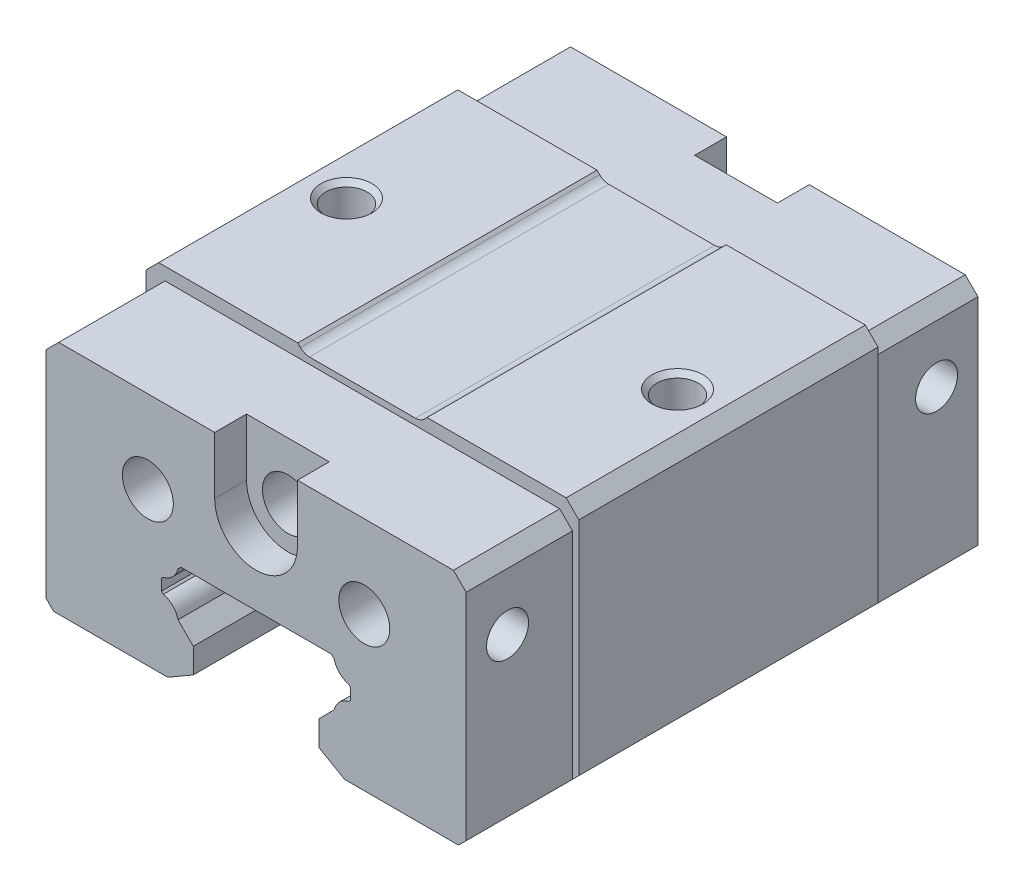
ISO-10303-21;
HEADER;
FILE_DESCRIPTION(('STEP AP214'),'2;1');
FILE_NAME('part.step','',(''),(''),'','','');
FILE_SCHEMA(('AUTOMOTIVE_DESIGN { 1 0 10303 214 1 1 1 1 }'));
ENDSEC;
DATA;
#1=APPLICATION_CONTEXT('core data for automotive mechanical design processes');
#2=APPLICATION_PROTOCOL_DEFINITION('international standard','automotive_design',2000,#1);
#3=PRODUCT_CONTEXT('',#1,'mechanical');
#4=PRODUCT('Part','Part','',(#3));
#5=PRODUCT_RELATED_PRODUCT_CATEGORY('part','',(#4));
#6=PRODUCT_DEFINITION_FORMATION('','',#4);
#7=PRODUCT_DEFINITION_CONTEXT('part definition',#1,'design');
#8=PRODUCT_DEFINITION('design','',#6,#7);
#9=PRODUCT_DEFINITION_SHAPE('','',#8);
#10=(LENGTH_UNIT() NAMED_UNIT(*) SI_UNIT(.MILLI.,.METRE.));
#11=(NAMED_UNIT(*) PLANE_ANGLE_UNIT() SI_UNIT($,.RADIAN.));
#12=(NAMED_UNIT(*) SI_UNIT($,.STERADIAN.) SOLID_ANGLE_UNIT());
#13=UNCERTAINTY_MEASURE_WITH_UNIT(LENGTH_MEASURE(1.E-05),#10,'distance_accuracy_value','');
#14=(GEOMETRIC_REPRESENTATION_CONTEXT(3) GLOBAL_UNCERTAINTY_ASSIGNED_CONTEXT((#13)) GLOBAL_UNIT_ASSIGNED_CONTEXT((#10,
#11,#12)) REPRESENTATION_CONTEXT('',''));
#15=CARTESIAN_POINT('',(0.,0.,0.));
#16=DIRECTION('',(0.,0.,1.));
#17=DIRECTION('',(1.,0.,0.));
#18=AXIS2_PLACEMENT_3D('',#15,#16,#17);
#19=CARTESIAN_POINT('',(-16.500000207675,-19.5,-40.2));
#20=DIRECTION('',(0.,0.,-1.));
#21=DIRECTION('',(0.,1.,0.));
#22=AXIS2_PLACEMENT_3D('',#19,#20,#21);
#23=PLANE('',#22);
#24=DIRECTION('',(0.,-1.,0.));
#25=VECTOR('',#24,1.);
#26=CARTESIAN_POINT('',(-3.25,-0.999999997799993,-40.2));
#27=LINE('',#26,#25);
#28=CARTESIAN_POINT('',(-3.25,-0.999999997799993,-40.2));
#29=VERTEX_POINT('',#28);
#30=CARTESIAN_POINT('',(-3.25,-5.5,-40.2));
#31=VERTEX_POINT('',#30);
#32=EDGE_CURVE('E381',#29,#31,#27,.T.);
#33=ORIENTED_EDGE('',*,*,#32,.T.);
#34=CARTESIAN_POINT('',(0.,-5.5,-40.2));
#35=DIRECTION('',(0.,0.,1.));
#36=DIRECTION('',(-1.,0.,0.));
#37=AXIS2_PLACEMENT_3D('',#34,#35,#36);
#38=CIRCLE('',#37,3.25);
#39=CARTESIAN_POINT('',(3.25,-5.5,-40.2));
#40=VERTEX_POINT('',#39);
#41=EDGE_CURVE('E369',#31,#40,#38,.T.);
#42=ORIENTED_EDGE('',*,*,#41,.T.);
#43=DIRECTION('',(0.,1.,0.));
#44=VECTOR('',#43,1.);
#45=CARTESIAN_POINT('',(3.25,-5.5,-40.2));
#46=LINE('',#45,#44);
#47=CARTESIAN_POINT('',(3.25,-0.999999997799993,-40.2));
#48=VERTEX_POINT('',#47);
#49=EDGE_CURVE('E380',#40,#48,#46,.T.);
#50=ORIENTED_EDGE('',*,*,#49,.T.);
#51=DIRECTION('',(1.,0.,0.));
#52=VECTOR('',#51,1.);
#53=CARTESIAN_POINT('',(3.25,-0.999999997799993,-40.2));
#54=LINE('',#53,#52);
#55=CARTESIAN_POINT('',(15.4999997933,-0.999999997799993,-40.2));
#56=VERTEX_POINT('',#55);
#57=EDGE_CURVE('E402',#56,#48,#54,.F.);
#58=ORIENTED_EDGE('',*,*,#57,.F.);
#59=DIRECTION('',(0.707106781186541,-0.707106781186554,0.));
#60=VECTOR('',#59,1.);
#61=CARTESIAN_POINT('',(15.4999997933,-0.999999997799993,-40.2));
#62=LINE('',#61,#60);
#63=CARTESIAN_POINT('',(16.4999997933,-1.9999999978,-40.2));
#64=VERTEX_POINT('',#63);
#65=EDGE_CURVE('E407',#64,#56,#62,.F.);
#66=ORIENTED_EDGE('',*,*,#65,.F.);
#67=DIRECTION('',(0.,-1.,0.));
#68=VECTOR('',#67,1.);
#69=CARTESIAN_POINT('',(16.4999997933,-1.9999999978,-40.2));
#70=LINE('',#69,#68);
#71=CARTESIAN_POINT('',(16.4999997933,-18.8999999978,-40.2));
#72=VERTEX_POINT('',#71);
#73=EDGE_CURVE('E411',#72,#64,#70,.F.);
#74=ORIENTED_EDGE('',*,*,#73,.F.);
#75=DIRECTION('',(-0.707106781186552,-0.707106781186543,0.));
#76=VECTOR('',#75,1.);
#77=CARTESIAN_POINT('',(16.4999997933,-18.8999999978,-40.2));
#78=LINE('',#77,#76);
#79=CARTESIAN_POINT('',(15.8999997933,-19.4999999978,-40.2));
#80=VERTEX_POINT('',#79);
#81=EDGE_CURVE('E415',#80,#72,#78,.F.);
#82=ORIENTED_EDGE('',*,*,#81,.F.);
#83=DIRECTION('',(-1.,-2.45567349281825E-10,0.));
#84=VECTOR('',#83,1.);
#85=CARTESIAN_POINT('',(15.8999997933,-19.4999999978,-40.2));
#86=LINE('',#85,#84);
#87=CARTESIAN_POINT('',(6.9411533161,-19.5,-40.2));
#88=VERTEX_POINT('',#87);
#89=EDGE_CURVE('E420',#88,#80,#86,.F.);
#90=ORIENTED_EDGE('',*,*,#89,.F.);
#91=DIRECTION('',(-0.86602540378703,0.499999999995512,0.));
#92=VECTOR('',#91,1.);
#93=CARTESIAN_POINT('',(6.94115331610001,-19.5,-40.2));
#94=LINE('',#93,#92);
#95=CARTESIAN_POINT('',(4.9299990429,-18.338859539,-40.2));
#96=VERTEX_POINT('',#95);
#97=EDGE_CURVE('E424',#96,#88,#94,.F.);
#98=ORIENTED_EDGE('',*,*,#97,.F.);
#99=DIRECTION('',(0.,1.,0.));
#100=VECTOR('',#99,1.);
#101=CARTESIAN_POINT('',(4.9299990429,-18.338859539,-40.2));
#102=LINE('',#101,#100);
#103=CARTESIAN_POINT('',(4.9299990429,-16.3860808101,-40.2));
#104=VERTEX_POINT('',#103);
#105=EDGE_CURVE('E429',#104,#96,#102,.F.);
#106=ORIENTED_EDGE('',*,*,#105,.F.);
#107=DIRECTION('',(0.707106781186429,0.707106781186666,0.));
#108=VECTOR('',#107,1.);
#109=CARTESIAN_POINT('',(4.9299990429,-16.3860808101,-40.2));
#110=LINE('',#109,#108);
#111=CARTESIAN_POINT('',(6.1305877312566,-15.185492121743,-40.2));
#112=VERTEX_POINT('',#111);
#113=EDGE_CURVE('E434',#112,#104,#110,.F.);
#114=ORIENTED_EDGE('',*,*,#113,.F.);
#115=CARTESIAN_POINT('',(7.63959702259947,-15.5395979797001,-40.2));
#116=DIRECTION('',(0.,0.,-1.));
#117=DIRECTION('',(-0.973554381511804,0.228455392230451,0.));
#118=AXIS2_PLACEMENT_3D('',#115,#116,#117);
#119=CIRCLE('',#118,1.54999999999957);
#120=CARTESIAN_POINT('',(7.2854911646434,-14.030588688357,-40.2));
#121=VERTEX_POINT('',#120);
#122=EDGE_CURVE('E439',#121,#112,#119,.F.);
#123=ORIENTED_EDGE('',*,*,#122,.F.);
#124=DIRECTION('',(0.707106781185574,0.707106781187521,0.));
#125=VECTOR('',#124,1.);
#126=CARTESIAN_POINT('',(7.2854911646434,-14.030588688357,-40.2));
#127=LINE('',#126,#125);
#128=CARTESIAN_POINT('',(7.4299990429,-13.8860808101,-40.2));
#129=VERTEX_POINT('',#128);
#130=EDGE_CURVE('E444',#129,#121,#127,.F.);
#131=ORIENTED_EDGE('',*,*,#130,.F.);
#132=DIRECTION('',(0.,1.,0.));
#133=VECTOR('',#132,1.);
#134=CARTESIAN_POINT('',(7.4299990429,-13.8860808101,-40.2));
#135=LINE('',#134,#133);
#136=CARTESIAN_POINT('',(7.4299990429,-13.0139191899,-40.2));
#137=VERTEX_POINT('',#136);
#138=EDGE_CURVE('E449',#137,#129,#135,.F.);
#139=ORIENTED_EDGE('',*,*,#138,.F.);
#140=DIRECTION('',(-0.70710678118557,0.707106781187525,0.));
#141=VECTOR('',#140,1.);
#142=CARTESIAN_POINT('',(7.4299990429,-13.0139191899,-40.2));
#143=LINE('',#142,#141);
#144=CARTESIAN_POINT('',(7.2854911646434,-12.869411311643,-40.2));
#145=VERTEX_POINT('',#144);
#146=EDGE_CURVE('E454',#145,#137,#143,.F.);
#147=ORIENTED_EDGE('',*,*,#146,.F.);
#148=CARTESIAN_POINT('',(7.63959702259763,-11.3604020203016,-40.2));
#149=DIRECTION('',(0.,0.,-1.));
#150=DIRECTION('',(-0.228455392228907,-0.973554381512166,0.));
#151=AXIS2_PLACEMENT_3D('',#148,#149,#150);
#152=CIRCLE('',#151,1.54999999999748);
#153=CARTESIAN_POINT('',(6.1305877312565,-11.714507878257,-40.2));
#154=VERTEX_POINT('',#153);
#155=EDGE_CURVE('E459',#154,#145,#152,.F.);
#156=ORIENTED_EDGE('',*,*,#155,.F.);
#157=DIRECTION('',(-0.707106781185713,0.707106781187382,0.));
#158=VECTOR('',#157,1.);
#159=CARTESIAN_POINT('',(6.1305877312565,-11.714507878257,-40.2));
#160=LINE('',#159,#158);
#161=CARTESIAN_POINT('',(5.916079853,-11.5,-40.2));
#162=VERTEX_POINT('',#161);
#163=EDGE_CURVE('E464',#162,#154,#160,.F.);
#164=ORIENTED_EDGE('',*,*,#163,.F.);
#165=DIRECTION('',(-1.,0.,0.));
#166=VECTOR('',#165,1.);
#167=CARTESIAN_POINT('',(5.916079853,-11.5,-40.2));
#168=LINE('',#167,#166);
#169=CARTESIAN_POINT('',(-5.9160802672,-11.5,-40.2));
#170=VERTEX_POINT('',#169);
#171=EDGE_CURVE('E469',#170,#162,#168,.F.);
#172=ORIENTED_EDGE('',*,*,#171,.F.);
#173=DIRECTION('',(-0.70710678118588,-0.707106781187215,0.));
#174=VECTOR('',#173,1.);
#175=CARTESIAN_POINT('',(-5.9160802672,-11.5,-40.2));
#176=LINE('',#175,#174);
#177=CARTESIAN_POINT('',(-6.1305881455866,-11.714507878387,-40.2));
#178=VERTEX_POINT('',#177);
#179=EDGE_CURVE('E474',#178,#170,#176,.F.);
#180=ORIENTED_EDGE('',*,*,#179,.F.);
#181=CARTESIAN_POINT('',(-7.63959743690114,-11.3604020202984,-40.2));
#182=DIRECTION('',(0.,0.,-1.));
#183=DIRECTION('',(0.973554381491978,-0.228455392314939,0.));
#184=AXIS2_PLACEMENT_3D('',#181,#182,#183);
#185=CIRCLE('',#184,1.55000000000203);
#186=CARTESIAN_POINT('',(-7.2854915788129,-12.869411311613,-40.2));
#187=VERTEX_POINT('',#186);
#188=EDGE_CURVE('E479',#187,#178,#185,.F.);
#189=ORIENTED_EDGE('',*,*,#188,.F.);
#190=DIRECTION('',(-0.7071067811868,-0.707106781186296,0.));
#191=VECTOR('',#190,1.);
#192=CARTESIAN_POINT('',(-7.2854915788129,-12.869411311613,-40.2));
#193=LINE('',#192,#191);
#194=CARTESIAN_POINT('',(-7.4299994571,-13.0139191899,-40.2));
#195=VERTEX_POINT('',#194);
#196=EDGE_CURVE('E484',#195,#187,#193,.F.);
#197=ORIENTED_EDGE('',*,*,#196,.F.);
#198=DIRECTION('',(0.,-1.,0.));
#199=VECTOR('',#198,1.);
#200=CARTESIAN_POINT('',(-7.4299994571,-13.0139191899,-40.2));
#201=LINE('',#200,#199);
#202=CARTESIAN_POINT('',(-7.4299994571,-13.8860808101,-40.2));
#203=VERTEX_POINT('',#202);
#204=EDGE_CURVE('E489',#203,#195,#201,.F.);
#205=ORIENTED_EDGE('',*,*,#204,.F.);
#206=DIRECTION('',(0.7071067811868,-0.707106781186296,0.));
#207=VECTOR('',#206,1.);
#208=CARTESIAN_POINT('',(-7.4299994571,-13.8860808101,-40.2));
#209=LINE('',#208,#207);
#210=CARTESIAN_POINT('',(-7.2854915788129,-14.030588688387,-40.2));
#211=VERTEX_POINT('',#210);
#212=EDGE_CURVE('E494',#211,#203,#209,.F.);
#213=ORIENTED_EDGE('',*,*,#212,.F.);
#214=CARTESIAN_POINT('',(-7.6395974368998,-15.5395979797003,-40.2));
#215=DIRECTION('',(0.,0.,-1.));
#216=DIRECTION('',(0.228455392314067,0.973554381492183,0.));
#217=AXIS2_PLACEMENT_3D('',#214,#215,#216);
#218=CIRCLE('',#217,1.55000000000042);
#219=CARTESIAN_POINT('',(-6.13058814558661,-15.185492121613,-40.2));
#220=VERTEX_POINT('',#219);
#221=EDGE_CURVE('E499',#220,#211,#218,.F.);
#222=ORIENTED_EDGE('',*,*,#221,.F.);
#223=DIRECTION('',(0.707106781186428,-0.707106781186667,0.));
#224=VECTOR('',#223,1.);
#225=CARTESIAN_POINT('',(-6.13058814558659,-15.185492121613,-40.2));
#226=LINE('',#225,#224);
#227=CARTESIAN_POINT('',(-4.9299994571,-16.3860808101,-40.2));
#228=VERTEX_POINT('',#227);
#229=EDGE_CURVE('E504',#228,#220,#226,.F.);
#230=ORIENTED_EDGE('',*,*,#229,.F.);
#231=DIRECTION('',(0.,-1.,0.));
#232=VECTOR('',#231,1.);
#233=CARTESIAN_POINT('',(-4.9299994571,-16.3860808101,-40.2));
#234=LINE('',#233,#232);
#235=CARTESIAN_POINT('',(-4.9299994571,-18.338859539,-40.2));
#236=VERTEX_POINT('',#235);
#237=EDGE_CURVE('E509',#236,#228,#234,.F.);
#238=ORIENTED_EDGE('',*,*,#237,.F.);
#239=DIRECTION('',(-0.866025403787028,-0.499999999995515,0.));
#240=VECTOR('',#239,1.);
#241=CARTESIAN_POINT('',(-4.9299994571,-18.338859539,-40.2));
#242=LINE('',#241,#240);
#243=CARTESIAN_POINT('',(-6.94115373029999,-19.5,-40.2));
#244=VERTEX_POINT('',#243);
#245=EDGE_CURVE('E514',#244,#236,#242,.F.);
#246=ORIENTED_EDGE('',*,*,#245,.F.);
#247=DIRECTION('',(-1.,2.45567349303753E-10,0.));
#248=VECTOR('',#247,1.);
#249=CARTESIAN_POINT('',(-6.94115373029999,-19.5,-40.2));
#250=LINE('',#249,#248);
#251=CARTESIAN_POINT('',(-15.9000002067,-19.4999999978,-40.2));
#252=VERTEX_POINT('',#251);
#253=EDGE_CURVE('E519',#252,#244,#250,.F.);
#254=ORIENTED_EDGE('',*,*,#253,.F.);
#255=DIRECTION('',(-0.707106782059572,0.707106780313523,0.));
#256=VECTOR('',#255,1.);
#257=CARTESIAN_POINT('',(-15.9000002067,-19.4999999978,-40.2));
#258=LINE('',#257,#256);
#259=CARTESIAN_POINT('',(-16.5000002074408,-18.8999999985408,-40.2));
#260=VERTEX_POINT('',#259);
#261=EDGE_CURVE('E524',#260,#252,#258,.F.);
#262=ORIENTED_EDGE('',*,*,#261,.F.);
#263=DIRECTION('',(4.38333393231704E-11,1.,0.));
#264=VECTOR('',#263,1.);
#265=CARTESIAN_POINT('',(-16.5000002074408,-18.8999999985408,-40.2));
#266=LINE('',#265,#264);
#267=CARTESIAN_POINT('',(-16.5000002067,-1.9999999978,-40.2));
#268=VERTEX_POINT('',#267);
#269=EDGE_CURVE('E529',#268,#260,#266,.F.);
#270=ORIENTED_EDGE('',*,*,#269,.F.);
#271=DIRECTION('',(0.707106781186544,0.707106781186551,0.));
#272=VECTOR('',#271,1.);
#273=CARTESIAN_POINT('',(-16.5000002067,-1.9999999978,-40.2));
#274=LINE('',#273,#272);
#275=CARTESIAN_POINT('',(-15.5000002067,-0.999999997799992,-40.2));
#276=VERTEX_POINT('',#275);
#277=EDGE_CURVE('E533',#276,#268,#274,.F.);
#278=ORIENTED_EDGE('',*,*,#277,.F.);
#279=DIRECTION('',(1.,0.,0.));
#280=VECTOR('',#279,1.);
#281=CARTESIAN_POINT('',(-15.5000002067,-0.999999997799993,-40.2));
#282=LINE('',#281,#280);
#283=EDGE_CURVE('E394',#29,#276,#282,.F.);
#284=ORIENTED_EDGE('',*,*,#283,.F.);
#285=EDGE_LOOP('',(#33,#42,#50,#58,#66,#74,#82,#90,#98,#106,#114,#123,#131,#139,#147,#156,#164,
#172,#180,#189,#197,#205,#213,#222,#230,#238,#246,#254,#262,#270,#278,#284));
#286=FACE_BOUND('',#285,.T.);
#287=CARTESIAN_POINT('',(-8.5,-7.5,-40.2));
#288=DIRECTION('',(0.,0.,1.));
#289=DIRECTION('',(-0.99999999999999,-1.42053959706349E-07,0.));
#290=AXIS2_PLACEMENT_3D('',#287,#288,#289);
#291=CIRCLE('',#290,2.);
#292=CARTESIAN_POINT('',(-10.5,-7.50000028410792,-40.2));
#293=VERTEX_POINT('',#292);
#294=EDGE_CURVE('E541',#293,#293,#291,.T.);
#295=ORIENTED_EDGE('',*,*,#294,.T.);
#296=EDGE_LOOP('',(#295));
#297=FACE_BOUND('',#296,.T.);
#298=CARTESIAN_POINT('',(8.4999985,-7.5,-40.2));
#299=DIRECTION('',(0.,0.,1.));
#300=DIRECTION('',(-1.,0.,0.));
#301=AXIS2_PLACEMENT_3D('',#298,#299,#300);
#302=CIRCLE('',#301,2.);
#303=CARTESIAN_POINT('',(6.4999985,-7.5,-40.2));
#304=VERTEX_POINT('',#303);
#305=EDGE_CURVE('E546',#304,#304,#302,.T.);
#306=ORIENTED_EDGE('',*,*,#305,.T.);
#307=EDGE_LOOP('',(#306));
#308=FACE_BOUND('',#307,.T.);
#309=ADVANCED_FACE('F17',(#286,#297,#308),#23,.T.);
#310=CARTESIAN_POINT('',(-15.5000002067,-0.99999999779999,-31.85));
#311=DIRECTION('',(0.,1.,0.));
#312=DIRECTION('',(1.,0.,0.));
#313=AXIS2_PLACEMENT_3D('',#310,#311,#312);
#314=PLANE('',#313);
#315=DIRECTION('',(0.,0.,-1.));
#316=VECTOR('',#315,1.);
#317=CARTESIAN_POINT('',(-3.25,-0.99999999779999,-37.7));
#318=LINE('',#317,#316);
#319=CARTESIAN_POINT('',(-3.25,-0.99999999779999,-37.7));
#320=VERTEX_POINT('',#319);
#321=EDGE_CURVE('E549',#29,#320,#318,.F.);
#322=ORIENTED_EDGE('',*,*,#321,.F.);
#323=ORIENTED_EDGE('',*,*,#283,.T.);
#324=DIRECTION('',(0.,0.,1.));
#325=VECTOR('',#324,1.);
#326=CARTESIAN_POINT('',(-15.5000002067,-0.99999999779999,-40.2));
#327=LINE('',#326,#325);
#328=CARTESIAN_POINT('',(-15.5000002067,-0.99999999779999,-31.85));
#329=VERTEX_POINT('',#328);
#330=EDGE_CURVE('E551',#329,#276,#327,.F.);
#331=ORIENTED_EDGE('',*,*,#330,.F.);
#332=DIRECTION('',(1.,0.,0.));
#333=VECTOR('',#332,1.);
#334=CARTESIAN_POINT('',(-15.5000002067,-0.99999999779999,-31.85));
#335=LINE('',#334,#333);
#336=CARTESIAN_POINT('',(15.4999997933,-0.99999999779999,-31.85));
#337=VERTEX_POINT('',#336);
#338=EDGE_CURVE('E555',#337,#329,#335,.F.);
#339=ORIENTED_EDGE('',*,*,#338,.F.);
#340=DIRECTION('',(0.,0.,-1.));
#341=VECTOR('',#340,1.);
#342=CARTESIAN_POINT('',(15.4999997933,-0.99999999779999,-31.85));
#343=LINE('',#342,#341);
#344=EDGE_CURVE('E559',#337,#56,#343,.T.);
#345=ORIENTED_EDGE('',*,*,#344,.T.);
#346=ORIENTED_EDGE('',*,*,#57,.T.);
#347=DIRECTION('',(0.,0.,1.));
#348=VECTOR('',#347,1.);
#349=CARTESIAN_POINT('',(3.25,-0.99999999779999,-40.2));
#350=LINE('',#349,#348);
#351=CARTESIAN_POINT('',(3.25,-0.99999999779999,-37.7));
#352=VERTEX_POINT('',#351);
#353=EDGE_CURVE('E564',#352,#48,#350,.F.);
#354=ORIENTED_EDGE('',*,*,#353,.F.);
#355=DIRECTION('',(-1.,0.,0.));
#356=VECTOR('',#355,1.);
#357=CARTESIAN_POINT('',(3.25,-0.99999999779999,-37.7));
#358=LINE('',#357,#356);
#359=EDGE_CURVE('E568',#352,#320,#358,.T.);
#360=ORIENTED_EDGE('',*,*,#359,.T.);
#361=EDGE_LOOP('',(#322,#323,#331,#339,#345,#346,#354,#360));
#362=FACE_BOUND('',#361,.T.);
#363=ADVANCED_FACE('F1271',(#362),#314,.T.);
#364=CARTESIAN_POINT('',(-17.0000002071,-6.,-31.85));
#365=DIRECTION('',(-1.,0.,0.));
#366=DIRECTION('',(0.,0.,1.));
#367=AXIS2_PLACEMENT_3D('',#364,#365,#366);
#368=PLANE('',#367);
#369=DIRECTION('',(0.,-1.,0.));
#370=VECTOR('',#369,1.);
#371=CARTESIAN_POINT('',(-17.0000002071,-1.,-31.85));
#372=LINE('',#371,#370);
#373=CARTESIAN_POINT('',(-17.0000002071,-6.,-31.85));
#374=VERTEX_POINT('',#373);
#375=CARTESIAN_POINT('',(-17.0000002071,-1.,-31.85));
#376=VERTEX_POINT('',#375);
#377=EDGE_CURVE('E573',#374,#376,#372,.F.);
#378=ORIENTED_EDGE('',*,*,#377,.F.);
#379=DIRECTION('',(0.,0.,1.));
#380=VECTOR('',#379,1.);
#381=CARTESIAN_POINT('',(-17.0000002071,-6.,-31.85));
#382=LINE('',#381,#380);
#383=CARTESIAN_POINT('',(-17.0000002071,-6.,-8.35));
#384=VERTEX_POINT('',#383);
#385=EDGE_CURVE('E577',#374,#384,#382,.T.);
#386=ORIENTED_EDGE('',*,*,#385,.T.);
#387=DIRECTION('',(0.,1.,0.));
#388=VECTOR('',#387,1.);
#389=CARTESIAN_POINT('',(-17.0000002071,-6.,-8.35));
#390=LINE('',#389,#388);
#391=CARTESIAN_POINT('',(-17.0000002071,-1.,-8.35));
#392=VERTEX_POINT('',#391);
#393=EDGE_CURVE('E582',#384,#392,#390,.T.);
#394=ORIENTED_EDGE('',*,*,#393,.T.);
#395=DIRECTION('',(0.,0.,-1.));
#396=VECTOR('',#395,1.);
#397=CARTESIAN_POINT('',(-17.0000002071,-1.,-8.35));
#398=LINE('',#397,#396);
#399=EDGE_CURVE('E587',#376,#392,#398,.F.);
#400=ORIENTED_EDGE('',*,*,#399,.F.);
#401=EDGE_LOOP('',(#378,#386,#394,#400));
#402=FACE_BOUND('',#401,.T.);
#403=ADVANCED_FACE('F1276',(#402),#368,.T.);
#404=CARTESIAN_POINT('',(-17.0000002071,-6.,-31.85));
#405=DIRECTION('',(-0.707105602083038,-0.707107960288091,0.));
#406=DIRECTION('',(0.707107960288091,-0.707105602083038,0.));
#407=AXIS2_PLACEMENT_3D('',#404,#405,#406);
#408=PLANE('',#407);
#409=DIRECTION('',(0.707107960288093,-0.707105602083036,0.));
#410=VECTOR('',#409,1.);
#411=CARTESIAN_POINT('',(-17.0000002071,-6.,-31.85));
#412=LINE('',#411,#410);
#413=CARTESIAN_POINT('',(-16.7000002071,-6.2999989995,-31.85));
#414=VERTEX_POINT('',#413);
#415=EDGE_CURVE('E592',#414,#374,#412,.F.);
#416=ORIENTED_EDGE('',*,*,#415,.F.);
#417=DIRECTION('',(0.,0.,1.));
#418=VECTOR('',#417,1.);
#419=CARTESIAN_POINT('',(-16.7000002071,-6.2999989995,-31.85));
#420=LINE('',#419,#418);
#421=CARTESIAN_POINT('',(-16.7000002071,-6.2999989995,-8.35));
#422=VERTEX_POINT('',#421);
#423=EDGE_CURVE('E596',#414,#422,#420,.T.);
#424=ORIENTED_EDGE('',*,*,#423,.T.);
#425=DIRECTION('',(-0.707107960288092,0.707105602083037,0.));
#426=VECTOR('',#425,1.);
#427=CARTESIAN_POINT('',(-16.7000002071,-6.2999989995,-8.35));
#428=LINE('',#427,#426);
#429=EDGE_CURVE('E601',#422,#384,#428,.T.);
#430=ORIENTED_EDGE('',*,*,#429,.T.);
#431=ORIENTED_EDGE('',*,*,#385,.F.);
#432=EDGE_LOOP('',(#416,#424,#430,#431));
#433=FACE_BOUND('',#432,.T.);
#434=ADVANCED_FACE('F1282',(#433),#408,.T.);
#435=CARTESIAN_POINT('',(-16.7000002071,-18.7,-31.85));
#436=DIRECTION('',(-1.,0.,0.));
#437=DIRECTION('',(0.,0.,1.));
#438=AXIS2_PLACEMENT_3D('',#435,#436,#437);
#439=PLANE('',#438);
#440=DIRECTION('',(0.,-1.,0.));
#441=VECTOR('',#440,1.);
#442=CARTESIAN_POINT('',(-16.7000002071,-6.2999989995,-31.85));
#443=LINE('',#442,#441);
#444=CARTESIAN_POINT('',(-16.7000002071,-18.7,-31.85));
#445=VERTEX_POINT('',#444);
#446=EDGE_CURVE('E606',#445,#414,#443,.F.);
#447=ORIENTED_EDGE('',*,*,#446,.F.);
#448=DIRECTION('',(0.,0.,1.));
#449=VECTOR('',#448,1.);
#450=CARTESIAN_POINT('',(-16.7000002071,-18.7,-31.85));
#451=LINE('',#450,#449);
#452=CARTESIAN_POINT('',(-16.7000002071,-18.7,-8.35));
#453=VERTEX_POINT('',#452);
#454=EDGE_CURVE('E610',#445,#453,#451,.T.);
#455=ORIENTED_EDGE('',*,*,#454,.T.);
#456=DIRECTION('',(0.,1.,0.));
#457=VECTOR('',#456,1.);
#458=CARTESIAN_POINT('',(-16.7000002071,-18.7,-8.35));
#459=LINE('',#458,#457);
#460=EDGE_CURVE('E615',#453,#422,#459,.T.);
#461=ORIENTED_EDGE('',*,*,#460,.T.);
#462=ORIENTED_EDGE('',*,*,#423,.F.);
#463=EDGE_LOOP('',(#447,#455,#461,#462));
#464=FACE_BOUND('',#463,.T.);
#465=ADVANCED_FACE('F1286',(#464),#439,.T.);
#466=CARTESIAN_POINT('',(-16.7000002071,-18.7,-40.2));
#467=DIRECTION('',(-0.707106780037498,-0.707106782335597,0.));
#468=DIRECTION('',(0.707106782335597,-0.707106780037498,0.));
#469=AXIS2_PLACEMENT_3D('',#466,#467,#468);
#470=PLANE('',#469);
#471=DIRECTION('',(0.707106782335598,-0.707106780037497,0.));
#472=VECTOR('',#471,1.);
#473=CARTESIAN_POINT('',(-16.7000002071,-18.7,-31.85));
#474=LINE('',#473,#472);
#475=CARTESIAN_POINT('',(-16.500000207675,-18.899999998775,-31.85));
#476=VERTEX_POINT('',#475);
#477=EDGE_CURVE('E620',#476,#445,#474,.F.);
#478=ORIENTED_EDGE('',*,*,#477,.F.);
#479=DIRECTION('',(0.,0.,-1.));
#480=VECTOR('',#479,1.);
#481=CARTESIAN_POINT('',(-16.500000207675,-18.899999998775,-31.85));
#482=LINE('',#481,#480);
#483=EDGE_CURVE('E624',#476,#260,#482,.T.);
#484=ORIENTED_EDGE('',*,*,#483,.T.);
#485=ORIENTED_EDGE('',*,*,#261,.T.);
#486=DIRECTION('',(0.,0.,1.));
#487=VECTOR('',#486,1.);
#488=CARTESIAN_POINT('',(-15.9000002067,-19.4999999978,-40.2));
#489=LINE('',#488,#487);
#490=CARTESIAN_POINT('',(-15.9000002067,-19.4999999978,0.));
#491=VERTEX_POINT('',#490);
#492=EDGE_CURVE('E629',#252,#491,#489,.T.);
#493=ORIENTED_EDGE('',*,*,#492,.T.);
#494=DIRECTION('',(-0.707106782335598,0.707106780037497,0.));
#495=VECTOR('',#494,1.);
#496=CARTESIAN_POINT('',(-15.9000002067,-19.4999999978,0.));
#497=LINE('',#496,#495);
#498=CARTESIAN_POINT('',(-16.5000002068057,-18.8999999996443,0.));
#499=VERTEX_POINT('',#498);
#500=EDGE_CURVE('E634',#499,#491,#497,.F.);
#501=ORIENTED_EDGE('',*,*,#500,.F.);
#502=DIRECTION('',(-8.95088128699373E-11,8.95088128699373E-11,-1.));
#503=VECTOR('',#502,1.);
#504=CARTESIAN_POINT('',(-16.5000002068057,-18.8999999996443,0.));
#505=LINE('',#504,#503);
#506=CARTESIAN_POINT('',(-16.5000002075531,-18.8999999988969,-8.35));
#507=VERTEX_POINT('',#506);
#508=EDGE_CURVE('E639',#507,#499,#505,.F.);
#509=ORIENTED_EDGE('',*,*,#508,.F.);
#510=DIRECTION('',(-0.707106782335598,0.707106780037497,0.));
#511=VECTOR('',#510,1.);
#512=CARTESIAN_POINT('',(-16.5000002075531,-18.8999999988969,-8.35));
#513=LINE('',#512,#511);
#514=EDGE_CURVE('E643',#507,#453,#513,.T.);
#515=ORIENTED_EDGE('',*,*,#514,.T.);
#516=ORIENTED_EDGE('',*,*,#454,.F.);
#517=EDGE_LOOP('',(#478,#484,#485,#493,#501,#509,#515,#516));
#518=FACE_BOUND('',#517,.T.);
#519=ADVANCED_FACE('F1290',(#518),#470,.T.);
#520=CARTESIAN_POINT('',(15.8999997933,-19.4999999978,-40.2));
#521=DIRECTION('',(0.707106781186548,-0.707106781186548,0.));
#522=DIRECTION('',(0.707106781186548,0.707106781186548,0.));
#523=AXIS2_PLACEMENT_3D('',#520,#521,#522);
#524=PLANE('',#523);
#525=DIRECTION('',(0.70710678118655,0.707106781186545,0.));
#526=VECTOR('',#525,1.);
#527=CARTESIAN_POINT('',(16.4999997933,-18.8999999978,-31.85));
#528=LINE('',#527,#526);
#529=CARTESIAN_POINT('',(16.9999997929,-18.3999999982,-31.85));
#530=VERTEX_POINT('',#529);
#531=CARTESIAN_POINT('',(16.4999997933,-18.8999999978,-31.85));
#532=VERTEX_POINT('',#531);
#533=EDGE_CURVE('E648',#530,#532,#528,.F.);
#534=ORIENTED_EDGE('',*,*,#533,.F.);
#535=DIRECTION('',(0.,0.,1.));
#536=VECTOR('',#535,1.);
#537=CARTESIAN_POINT('',(16.9999997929,-18.3999999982,-31.85));
#538=LINE('',#537,#536);
#539=CARTESIAN_POINT('',(16.9999997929,-18.3999999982,-8.35));
#540=VERTEX_POINT('',#539);
#541=EDGE_CURVE('E652',#530,#540,#538,.T.);
#542=ORIENTED_EDGE('',*,*,#541,.T.);
#543=DIRECTION('',(-0.707106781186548,-0.707106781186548,0.));
#544=VECTOR('',#543,1.);
#545=CARTESIAN_POINT('',(16.9999997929,-18.3999999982,-8.35));
#546=LINE('',#545,#544);
#547=CARTESIAN_POINT('',(16.4999997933,-18.8999999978,-8.35));
#548=VERTEX_POINT('',#547);
#549=EDGE_CURVE('E657',#540,#548,#546,.T.);
#550=ORIENTED_EDGE('',*,*,#549,.T.);
#551=DIRECTION('',(0.,0.,1.));
#552=VECTOR('',#551,1.);
#553=CARTESIAN_POINT('',(16.4999997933,-18.8999999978,-8.35));
#554=LINE('',#553,#552);
#555=CARTESIAN_POINT('',(16.4999997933,-18.8999999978,0.));
#556=VERTEX_POINT('',#555);
#557=EDGE_CURVE('E662',#548,#556,#554,.T.);
#558=ORIENTED_EDGE('',*,*,#557,.T.);
#559=DIRECTION('',(-0.707106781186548,-0.707106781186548,0.));
#560=VECTOR('',#559,1.);
#561=CARTESIAN_POINT('',(16.4999997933,-18.8999999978,0.));
#562=LINE('',#561,#560);
#563=CARTESIAN_POINT('',(15.8999997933,-19.4999999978,0.));
#564=VERTEX_POINT('',#563);
#565=EDGE_CURVE('E667',#564,#556,#562,.F.);
#566=ORIENTED_EDGE('',*,*,#565,.F.);
#567=DIRECTION('',(0.,0.,-1.));
#568=VECTOR('',#567,1.);
#569=CARTESIAN_POINT('',(15.8999997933,-19.4999999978,0.));
#570=LINE('',#569,#568);
#571=EDGE_CURVE('E672',#80,#564,#570,.F.);
#572=ORIENTED_EDGE('',*,*,#571,.F.);
#573=ORIENTED_EDGE('',*,*,#81,.T.);
#574=DIRECTION('',(0.,0.,1.));
#575=VECTOR('',#574,1.);
#576=CARTESIAN_POINT('',(16.4999997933,-18.8999999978,-40.2));
#577=LINE('',#576,#575);
#578=EDGE_CURVE('E676',#532,#72,#577,.F.);
#579=ORIENTED_EDGE('',*,*,#578,.F.);
#580=EDGE_LOOP('',(#534,#542,#550,#558,#566,#572,#573,#579));
#581=FACE_BOUND('',#580,.T.);
#582=ADVANCED_FACE('F1294',(#581),#524,.T.);
#583=CARTESIAN_POINT('',(16.9999997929,-18.3999999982,-8.35));
#584=DIRECTION('',(1.,0.,0.));
#585=DIRECTION('',(0.,0.,-1.));
#586=AXIS2_PLACEMENT_3D('',#583,#584,#585);
#587=PLANE('',#586);
#588=DIRECTION('',(0.,1.,0.));
#589=VECTOR('',#588,1.);
#590=CARTESIAN_POINT('',(16.9999997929,-18.3999999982,-31.85));
#591=LINE('',#590,#589);
#592=CARTESIAN_POINT('',(16.9999997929,-1.,-31.85));
#593=VERTEX_POINT('',#592);
#594=EDGE_CURVE('E680',#593,#530,#591,.F.);
#595=ORIENTED_EDGE('',*,*,#594,.F.);
#596=DIRECTION('',(0.,0.,1.));
#597=VECTOR('',#596,1.);
#598=CARTESIAN_POINT('',(16.9999997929,-1.,-31.85));
#599=LINE('',#598,#597);
#600=CARTESIAN_POINT('',(16.9999997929,-1.,-8.35));
#601=VERTEX_POINT('',#600);
#602=EDGE_CURVE('E684',#593,#601,#599,.T.);
#603=ORIENTED_EDGE('',*,*,#602,.T.);
#604=DIRECTION('',(0.,-1.,0.));
#605=VECTOR('',#604,1.);
#606=CARTESIAN_POINT('',(16.9999997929,-1.,-8.35));
#607=LINE('',#606,#605);
#608=EDGE_CURVE('E689',#601,#540,#607,.T.);
#609=ORIENTED_EDGE('',*,*,#608,.T.);
#610=ORIENTED_EDGE('',*,*,#541,.F.);
#611=EDGE_LOOP('',(#595,#603,#609,#610));
#612=FACE_BOUND('',#611,.T.);
#613=ADVANCED_FACE('F1298',(#612),#587,.T.);
#614=CARTESIAN_POINT('',(16.9999997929,-1.,-31.85));
#615=DIRECTION('',(0.707106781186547,0.707106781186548,0.));
#616=DIRECTION('',(-0.707106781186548,0.707106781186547,0.));
#617=AXIS2_PLACEMENT_3D('',#614,#615,#616);
#618=PLANE('',#617);
#619=DIRECTION('',(-0.707106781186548,0.707106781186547,0.));
#620=VECTOR('',#619,1.);
#621=CARTESIAN_POINT('',(16.9999997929,-1.,-31.85));
#622=LINE('',#621,#620);
#623=CARTESIAN_POINT('',(15.9999997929,0.,-31.85));
#624=VERTEX_POINT('',#623);
#625=EDGE_CURVE('E694',#624,#593,#622,.F.);
#626=ORIENTED_EDGE('',*,*,#625,.F.);
#627=DIRECTION('',(0.,0.,1.));
#628=VECTOR('',#627,1.);
#629=CARTESIAN_POINT('',(15.9999997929,0.,-31.85));
#630=LINE('',#629,#628);
#631=CARTESIAN_POINT('',(15.9999997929,0.,-8.35));
#632=VERTEX_POINT('',#631);
#633=EDGE_CURVE('E698',#624,#632,#630,.T.);
#634=ORIENTED_EDGE('',*,*,#633,.T.);
#635=DIRECTION('',(0.707106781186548,-0.707106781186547,0.));
#636=VECTOR('',#635,1.);
#637=CARTESIAN_POINT('',(15.9999997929,0.,-8.35));
#638=LINE('',#637,#636);
#639=EDGE_CURVE('E703',#632,#601,#638,.T.);
#640=ORIENTED_EDGE('',*,*,#639,.T.);
#641=ORIENTED_EDGE('',*,*,#602,.F.);
#642=EDGE_LOOP('',(#626,#634,#640,#641));
#643=FACE_BOUND('',#642,.T.);
#644=ADVANCED_FACE('F1302',(#643),#618,.T.);
#645=CARTESIAN_POINT('',(5.0757365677,0.,-31.85));
#646=DIRECTION('',(0.,1.,0.));
#647=DIRECTION('',(0.,0.,1.));
#648=AXIS2_PLACEMENT_3D('',#645,#646,#647);
#649=PLANE('',#648);
#650=DIRECTION('',(-1.,0.,0.));
#651=VECTOR('',#650,1.);
#652=CARTESIAN_POINT('',(15.9999997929,0.,-31.85));
#653=LINE('',#652,#651);
#654=CARTESIAN_POINT('',(5.0757365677,0.,-31.85));
#655=VERTEX_POINT('',#654);
#656=EDGE_CURVE('E708',#655,#624,#653,.F.);
#657=ORIENTED_EDGE('',*,*,#656,.F.);
#658=DIRECTION('',(0.,0.,1.));
#659=VECTOR('',#658,1.);
#660=CARTESIAN_POINT('',(5.0757365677,0.,-31.85));
#661=LINE('',#660,#659);
#662=CARTESIAN_POINT('',(5.0757365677,0.,-8.35));
#663=VERTEX_POINT('',#662);
#664=EDGE_CURVE('E712',#655,#663,#661,.T.);
#665=ORIENTED_EDGE('',*,*,#664,.T.);
#666=DIRECTION('',(1.,0.,0.));
#667=VECTOR('',#666,1.);
#668=CARTESIAN_POINT('',(5.0757365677,0.,-8.35));
#669=LINE('',#668,#667);
#670=EDGE_CURVE('E717',#663,#632,#669,.T.);
#671=ORIENTED_EDGE('',*,*,#670,.T.);
#672=ORIENTED_EDGE('',*,*,#633,.F.);
#673=EDGE_LOOP('',(#657,#665,#671,#672));
#674=FACE_BOUND('',#673,.T.);
#675=CARTESIAN_POINT('',(13.,0.,-20.1));
#676=DIRECTION('',(0.,-1.,0.));
#677=DIRECTION('',(0.,0.,1.));
#678=AXIS2_PLACEMENT_3D('',#675,#676,#677);
#679=CIRCLE('',#678,2.);
#680=CARTESIAN_POINT('',(13.,0.,-18.1));
#681=VERTEX_POINT('',#680);
#682=EDGE_CURVE('E722',#681,#681,#679,.T.);
#683=ORIENTED_EDGE('',*,*,#682,.T.);
#684=EDGE_LOOP('',(#683));
#685=FACE_BOUND('',#684,.T.);
#686=ADVANCED_FACE('F1306',(#674,#685),#649,.T.);
#687=CARTESIAN_POINT('',(5.0757365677,0.,-31.85));
#688=DIRECTION('',(-0.707107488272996,0.707106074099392,0.));
#689=DIRECTION('',(-0.707106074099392,-0.707107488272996,0.));
#690=AXIS2_PLACEMENT_3D('',#687,#688,#689);
#691=PLANE('',#690);
#692=DIRECTION('',(-0.707106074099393,-0.707107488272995,0.));
#693=VECTOR('',#692,1.);
#694=CARTESIAN_POINT('',(5.0757365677,0.,-31.85));
#695=LINE('',#694,#693);
#696=CARTESIAN_POINT('',(4.8686309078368,-0.20710607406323,-31.85));
#697=VERTEX_POINT('',#696);
#698=EDGE_CURVE('E727',#697,#655,#695,.F.);
#699=ORIENTED_EDGE('',*,*,#698,.F.);
#700=DIRECTION('',(0.,0.,1.));
#701=VECTOR('',#700,1.);
#702=CARTESIAN_POINT('',(4.8686309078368,-0.20710607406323,-31.85));
#703=LINE('',#702,#701);
#704=CARTESIAN_POINT('',(4.8686309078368,-0.207106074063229,-8.35));
#705=VERTEX_POINT('',#704);
#706=EDGE_CURVE('E729',#697,#705,#703,.T.);
#707=ORIENTED_EDGE('',*,*,#706,.T.);
#708=DIRECTION('',(0.707106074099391,0.707107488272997,0.));
#709=VECTOR('',#708,1.);
#710=CARTESIAN_POINT('',(4.8686309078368,-0.207106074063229,-8.35));
#711=LINE('',#710,#709);
#712=EDGE_CURVE('E734',#705,#663,#711,.T.);
#713=ORIENTED_EDGE('',*,*,#712,.T.);
#714=ORIENTED_EDGE('',*,*,#664,.F.);
#715=EDGE_LOOP('',(#699,#707,#713,#714));
#716=FACE_BOUND('',#715,.T.);
#717=ADVANCED_FACE('F1310',(#716),#691,.T.);
#718=CARTESIAN_POINT('',(4.16152341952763,0.500000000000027,-40.2));
#719=DIRECTION('',(0.,0.,1.));
#720=DIRECTION('',(7.2369482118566E-11,-1.,0.));
#721=AXIS2_PLACEMENT_3D('',#718,#719,#720);
#722=CYLINDRICAL_SURFACE('',#721,1.00000000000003);
#723=ORIENTED_EDGE('',*,*,#706,.F.);
#724=CARTESIAN_POINT('',(4.16152341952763,0.500000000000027,-31.85));
#725=DIRECTION('',(0.,0.,-1.));
#726=DIRECTION('',(0.707107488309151,-0.707106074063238,0.));
#727=AXIS2_PLACEMENT_3D('',#724,#725,#726);
#728=CIRCLE('',#727,1.00000000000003);
#729=CARTESIAN_POINT('',(4.1615234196,-0.499999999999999,-31.85));
#730=VERTEX_POINT('',#729);
#731=EDGE_CURVE('E739',#697,#730,#728,.T.);
#732=ORIENTED_EDGE('',*,*,#731,.T.);
#733=DIRECTION('',(0.,0.,1.));
#734=VECTOR('',#733,1.);
#735=CARTESIAN_POINT('',(4.1615234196,-0.499999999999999,-31.85));
#736=LINE('',#735,#734);
#737=CARTESIAN_POINT('',(4.1615234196,-0.499999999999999,-8.35));
#738=VERTEX_POINT('',#737);
#739=EDGE_CURVE('E744',#730,#738,#736,.T.);
#740=ORIENTED_EDGE('',*,*,#739,.T.);
#741=CARTESIAN_POINT('',(4.16152341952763,0.500000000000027,-8.35));
#742=DIRECTION('',(0.,0.,1.));
#743=DIRECTION('',(7.23687776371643E-11,-1.,0.));
#744=AXIS2_PLACEMENT_3D('',#741,#742,#743);
#745=CIRCLE('',#744,1.00000000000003);
#746=EDGE_CURVE('E749',#705,#738,#745,.F.);
#747=ORIENTED_EDGE('',*,*,#746,.F.);
#748=EDGE_LOOP('',(#723,#732,#740,#747));
#749=FACE_BOUND('',#748,.T.);
#750=ADVANCED_FACE('F1314',(#749),#722,.F.);
#751=CARTESIAN_POINT('',(-4.16152383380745,-0.5,-31.85));
#752=DIRECTION('',(0.,1.,0.));
#753=DIRECTION('',(0.,0.,1.));
#754=AXIS2_PLACEMENT_3D('',#751,#752,#753);
#755=PLANE('',#754);
#756=DIRECTION('',(-1.,0.,0.));
#757=VECTOR('',#756,1.);
#758=CARTESIAN_POINT('',(4.1615234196,-0.5,-31.85));
#759=LINE('',#758,#757);
#760=CARTESIAN_POINT('',(-4.16152383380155,-0.5,-31.85));
#761=VERTEX_POINT('',#760);
#762=EDGE_CURVE('E753',#761,#730,#759,.F.);
#763=ORIENTED_EDGE('',*,*,#762,.F.);
#764=DIRECTION('',(-2.50806467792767E-13,0.,1.));
#765=VECTOR('',#764,1.);
#766=CARTESIAN_POINT('',(-4.16152383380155,-0.5,-31.85));
#767=LINE('',#766,#765);
#768=CARTESIAN_POINT('',(-4.16152383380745,-0.5,-8.35));
#769=VERTEX_POINT('',#768);
#770=EDGE_CURVE('E757',#761,#769,#767,.T.);
#771=ORIENTED_EDGE('',*,*,#770,.T.);
#772=DIRECTION('',(1.,0.,0.));
#773=VECTOR('',#772,1.);
#774=CARTESIAN_POINT('',(-4.16152383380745,-0.5,-8.35));
#775=LINE('',#774,#773);
#776=EDGE_CURVE('E762',#769,#738,#775,.T.);
#777=ORIENTED_EDGE('',*,*,#776,.T.);
#778=ORIENTED_EDGE('',*,*,#739,.F.);
#779=EDGE_LOOP('',(#763,#771,#777,#778));
#780=FACE_BOUND('',#779,.T.);
#781=ADVANCED_FACE('F1318',(#780),#755,.T.);
#782=CARTESIAN_POINT('',(-4.16152383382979,0.499999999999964,-40.2));
#783=DIRECTION('',(0.,0.,1.));
#784=DIRECTION('',(-0.707108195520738,-0.707105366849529,0.));
#785=AXIS2_PLACEMENT_3D('',#782,#783,#784);
#786=CYLINDRICAL_SURFACE('',#785,0.999999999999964);
#787=ORIENTED_EDGE('',*,*,#770,.F.);
#788=CARTESIAN_POINT('',(-4.16152383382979,0.499999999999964,-31.85));
#789=DIRECTION('',(0.,0.,-1.));
#790=DIRECTION('',(2.82369683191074E-11,-1.,0.));
#791=AXIS2_PLACEMENT_3D('',#788,#789,#790);
#792=CIRCLE('',#791,0.999999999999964);
#793=CARTESIAN_POINT('',(-4.8686320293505,-0.207105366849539,-31.85));
#794=VERTEX_POINT('',#793);
#795=EDGE_CURVE('E767',#761,#794,#792,.T.);
#796=ORIENTED_EDGE('',*,*,#795,.T.);
#797=DIRECTION('',(0.,0.,1.));
#798=VECTOR('',#797,1.);
#799=CARTESIAN_POINT('',(-4.8686320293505,-0.207105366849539,-31.85));
#800=LINE('',#799,#798);
#801=CARTESIAN_POINT('',(-4.8686320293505,-0.20710536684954,-8.35));
#802=VERTEX_POINT('',#801);
#803=EDGE_CURVE('E772',#794,#802,#800,.T.);
#804=ORIENTED_EDGE('',*,*,#803,.T.);
#805=CARTESIAN_POINT('',(-4.16152383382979,0.499999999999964,-8.35));
#806=DIRECTION('',(0.,0.,1.));
#807=DIRECTION('',(-0.707108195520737,-0.70710536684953,0.));
#808=AXIS2_PLACEMENT_3D('',#805,#806,#807);
#809=CIRCLE('',#808,0.999999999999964);
#810=EDGE_CURVE('E777',#769,#802,#809,.F.);
#811=ORIENTED_EDGE('',*,*,#810,.F.);
#812=EDGE_LOOP('',(#787,#796,#804,#811));
#813=FACE_BOUND('',#812,.T.);
#814=ADVANCED_FACE('F1322',(#813),#786,.F.);
#815=CARTESIAN_POINT('',(-4.8686320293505,-0.20710536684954,-31.85));
#816=DIRECTION('',(0.707108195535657,0.707105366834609,0.));
#817=DIRECTION('',(-0.707105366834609,0.707108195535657,0.));
#818=AXIS2_PLACEMENT_3D('',#815,#816,#817);
#819=PLANE('',#818);
#820=DIRECTION('',(-0.707105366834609,0.707108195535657,0.));
#821=VECTOR('',#820,1.);
#822=CARTESIAN_POINT('',(-4.8686320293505,-0.207105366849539,-31.85));
#823=LINE('',#822,#821);
#824=CARTESIAN_POINT('',(-5.0757365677,0.,-31.85));
#825=VERTEX_POINT('',#824);
#826=EDGE_CURVE('E781',#825,#794,#823,.F.);
#827=ORIENTED_EDGE('',*,*,#826,.F.);
#828=DIRECTION('',(0.,0.,1.));
#829=VECTOR('',#828,1.);
#830=CARTESIAN_POINT('',(-5.0757365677,0.,-31.85));
#831=LINE('',#830,#829);
#832=CARTESIAN_POINT('',(-5.0757365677,0.,-8.35));
#833=VERTEX_POINT('',#832);
#834=EDGE_CURVE('E785',#825,#833,#831,.T.);
#835=ORIENTED_EDGE('',*,*,#834,.T.);
#836=DIRECTION('',(0.707105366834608,-0.707108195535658,0.));
#837=VECTOR('',#836,1.);
#838=CARTESIAN_POINT('',(-5.0757365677,0.,-8.35));
#839=LINE('',#838,#837);
#840=EDGE_CURVE('E790',#833,#802,#839,.T.);
#841=ORIENTED_EDGE('',*,*,#840,.T.);
#842=ORIENTED_EDGE('',*,*,#803,.F.);
#843=EDGE_LOOP('',(#827,#835,#841,#842));
#844=FACE_BOUND('',#843,.T.);
#845=ADVANCED_FACE('F1326',(#844),#819,.T.);
#846=CARTESIAN_POINT('',(-16.0000002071,0.,-31.85));
#847=DIRECTION('',(0.,1.,0.));
#848=DIRECTION('',(0.,0.,1.));
#849=AXIS2_PLACEMENT_3D('',#846,#847,#848);
#850=PLANE('',#849);
#851=DIRECTION('',(-1.,0.,0.));
#852=VECTOR('',#851,1.);
#853=CARTESIAN_POINT('',(-5.0757365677,0.,-31.85));
#854=LINE('',#853,#852);
#855=CARTESIAN_POINT('',(-16.0000002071,0.,-31.85));
#856=VERTEX_POINT('',#855);
#857=EDGE_CURVE('E795',#856,#825,#854,.F.);
#858=ORIENTED_EDGE('',*,*,#857,.F.);
#859=DIRECTION('',(0.,0.,1.));
#860=VECTOR('',#859,1.);
#861=CARTESIAN_POINT('',(-16.0000002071,0.,-31.85));
#862=LINE('',#861,#860);
#863=CARTESIAN_POINT('',(-16.0000002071,0.,-8.35));
#864=VERTEX_POINT('',#863);
#865=EDGE_CURVE('E799',#856,#864,#862,.T.);
#866=ORIENTED_EDGE('',*,*,#865,.T.);
#867=DIRECTION('',(1.,0.,0.));
#868=VECTOR('',#867,1.);
#869=CARTESIAN_POINT('',(-16.0000002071,0.,-8.35));
#870=LINE('',#869,#868);
#871=EDGE_CURVE('E804',#864,#833,#870,.T.);
#872=ORIENTED_EDGE('',*,*,#871,.T.);
#873=ORIENTED_EDGE('',*,*,#834,.F.);
#874=EDGE_LOOP('',(#858,#866,#872,#873));
#875=FACE_BOUND('',#874,.T.);
#876=CARTESIAN_POINT('',(-13.,0.,-20.1));
#877=DIRECTION('',(0.,-1.,0.));
#878=DIRECTION('',(0.,0.,1.));
#879=AXIS2_PLACEMENT_3D('',#876,#877,#878);
#880=CIRCLE('',#879,2.);
#881=CARTESIAN_POINT('',(-13.,0.,-18.1));
#882=VERTEX_POINT('',#881);
#883=EDGE_CURVE('E809',#882,#882,#880,.T.);
#884=ORIENTED_EDGE('',*,*,#883,.T.);
#885=EDGE_LOOP('',(#884));
#886=FACE_BOUND('',#885,.T.);
#887=ADVANCED_FACE('F1330',(#875,#886),#850,.T.);
#888=CARTESIAN_POINT('',(-16.0000002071,0.,-31.85));
#889=DIRECTION('',(-0.707106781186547,0.707106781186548,0.));
#890=DIRECTION('',(-0.707106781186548,-0.707106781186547,0.));
#891=AXIS2_PLACEMENT_3D('',#888,#889,#890);
#892=PLANE('',#891);
#893=DIRECTION('',(-0.707106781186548,-0.707106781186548,0.));
#894=VECTOR('',#893,1.);
#895=CARTESIAN_POINT('',(-16.0000002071,0.,-31.85));
#896=LINE('',#895,#894);
#897=EDGE_CURVE('E814',#376,#856,#896,.F.);
#898=ORIENTED_EDGE('',*,*,#897,.F.);
#899=ORIENTED_EDGE('',*,*,#399,.T.);
#900=DIRECTION('',(0.707106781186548,0.707106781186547,0.));
#901=VECTOR('',#900,1.);
#902=CARTESIAN_POINT('',(-17.0000002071,-1.,-8.35));
#903=LINE('',#902,#901);
#904=EDGE_CURVE('E816',#392,#864,#903,.T.);
#905=ORIENTED_EDGE('',*,*,#904,.T.);
#906=ORIENTED_EDGE('',*,*,#865,.F.);
#907=EDGE_LOOP('',(#898,#899,#905,#906));
#908=FACE_BOUND('',#907,.T.);
#909=ADVANCED_FACE('F1334',(#908),#892,.T.);
#910=CARTESIAN_POINT('',(-16.5000002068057,-19.5,0.));
#911=DIRECTION('',(0.,0.,1.));
#912=DIRECTION('',(1.,0.,0.));
#913=AXIS2_PLACEMENT_3D('',#910,#911,#912);
#914=PLANE('',#913);
#915=DIRECTION('',(0.,1.,0.));
#916=VECTOR('',#915,1.);
#917=CARTESIAN_POINT('',(-3.25,-5.5,0.));
#918=LINE('',#917,#916);
#919=CARTESIAN_POINT('',(-3.25,-0.999999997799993,0.));
#920=VERTEX_POINT('',#919);
#921=CARTESIAN_POINT('',(-3.25,-5.5,0.));
#922=VERTEX_POINT('',#921);
#923=EDGE_CURVE('E821',#920,#922,#918,.F.);
#924=ORIENTED_EDGE('',*,*,#923,.F.);
#925=DIRECTION('',(-1.,0.,0.));
#926=VECTOR('',#925,1.);
#927=CARTESIAN_POINT('',(-3.25,-0.999999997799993,0.));
#928=LINE('',#927,#926);
#929=CARTESIAN_POINT('',(-15.5000002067,-0.999999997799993,0.));
#930=VERTEX_POINT('',#929);
#931=EDGE_CURVE('E826',#920,#930,#928,.T.);
#932=ORIENTED_EDGE('',*,*,#931,.T.);
#933=DIRECTION('',(-0.707106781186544,-0.707106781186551,0.));
#934=VECTOR('',#933,1.);
#935=CARTESIAN_POINT('',(-15.5000002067,-0.999999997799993,0.));
#936=LINE('',#935,#934);
#937=CARTESIAN_POINT('',(-16.5000002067,-1.9999999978,0.));
#938=VERTEX_POINT('',#937);
#939=EDGE_CURVE('E831',#930,#938,#936,.T.);
#940=ORIENTED_EDGE('',*,*,#939,.T.);
#941=DIRECTION('',(-6.25613958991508E-12,-1.,0.));
#942=VECTOR('',#941,1.);
#943=CARTESIAN_POINT('',(-16.5000002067,-1.9999999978,0.));
#944=LINE('',#943,#942);
#945=EDGE_CURVE('E836',#938,#499,#944,.T.);
#946=ORIENTED_EDGE('',*,*,#945,.T.);
#947=ORIENTED_EDGE('',*,*,#500,.T.);
#948=DIRECTION('',(1.,-2.45567349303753E-10,0.));
#949=VECTOR('',#948,1.);
#950=CARTESIAN_POINT('',(-15.9000002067,-19.4999999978,0.));
#951=LINE('',#950,#949);
#952=CARTESIAN_POINT('',(-6.9411537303,-19.5,0.));
#953=VERTEX_POINT('',#952);
#954=EDGE_CURVE('E841',#491,#953,#951,.T.);
#955=ORIENTED_EDGE('',*,*,#954,.T.);
#956=DIRECTION('',(0.866025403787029,0.499999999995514,0.));
#957=VECTOR('',#956,1.);
#958=CARTESIAN_POINT('',(-6.9411537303,-19.5,0.));
#959=LINE('',#958,#957);
#960=CARTESIAN_POINT('',(-4.9299994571,-18.338859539,0.));
#961=VERTEX_POINT('',#960);
#962=EDGE_CURVE('E846',#953,#961,#959,.T.);
#963=ORIENTED_EDGE('',*,*,#962,.T.);
#964=DIRECTION('',(0.,1.,0.));
#965=VECTOR('',#964,1.);
#966=CARTESIAN_POINT('',(-4.9299994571,-18.338859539,0.));
#967=LINE('',#966,#965);
#968=CARTESIAN_POINT('',(-4.9299994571,-16.3860808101,0.));
#969=VERTEX_POINT('',#968);
#970=EDGE_CURVE('E851',#961,#969,#967,.T.);
#971=ORIENTED_EDGE('',*,*,#970,.T.);
#972=DIRECTION('',(-0.707106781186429,0.707106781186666,0.));
#973=VECTOR('',#972,1.);
#974=CARTESIAN_POINT('',(-4.9299994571,-16.3860808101,0.));
#975=LINE('',#974,#973);
#976=CARTESIAN_POINT('',(-6.1305881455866,-15.185492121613,0.));
#977=VERTEX_POINT('',#976);
#978=EDGE_CURVE('E856',#969,#977,#975,.T.);
#979=ORIENTED_EDGE('',*,*,#978,.T.);
#980=CARTESIAN_POINT('',(-7.6395974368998,-15.5395979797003,0.));
#981=DIRECTION('',(0.,0.,1.));
#982=DIRECTION('',(0.973554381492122,0.228455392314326,0.));
#983=AXIS2_PLACEMENT_3D('',#980,#981,#982);
#984=CIRCLE('',#983,1.55000000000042);
#985=CARTESIAN_POINT('',(-7.2854915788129,-14.030588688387,0.));
#986=VERTEX_POINT('',#985);
#987=EDGE_CURVE('E861',#977,#986,#984,.T.);
#988=ORIENTED_EDGE('',*,*,#987,.T.);
#989=DIRECTION('',(-0.707106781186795,0.7071067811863,0.));
#990=VECTOR('',#989,1.);
#991=CARTESIAN_POINT('',(-7.2854915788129,-14.030588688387,0.));
#992=LINE('',#991,#990);
#993=CARTESIAN_POINT('',(-7.4299994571,-13.8860808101,0.));
#994=VERTEX_POINT('',#993);
#995=EDGE_CURVE('E866',#986,#994,#992,.T.);
#996=ORIENTED_EDGE('',*,*,#995,.T.);
#997=DIRECTION('',(0.,1.,0.));
#998=VECTOR('',#997,1.);
#999=CARTESIAN_POINT('',(-7.4299994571,-13.8860808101,0.));
#1000=LINE('',#999,#998);
#1001=CARTESIAN_POINT('',(-7.4299994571,-13.0139191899,0.));
#1002=VERTEX_POINT('',#1001);
#1003=EDGE_CURVE('E871',#994,#1002,#1000,.T.);
#1004=ORIENTED_EDGE('',*,*,#1003,.T.);
#1005=DIRECTION('',(0.707106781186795,0.7071067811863,0.));
#1006=VECTOR('',#1005,1.);
#1007=CARTESIAN_POINT('',(-7.4299994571,-13.0139191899,0.));
#1008=LINE('',#1007,#1006);
#1009=CARTESIAN_POINT('',(-7.2854915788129,-12.869411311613,0.));
#1010=VERTEX_POINT('',#1009);
#1011=EDGE_CURVE('E876',#1002,#1010,#1008,.T.);
#1012=ORIENTED_EDGE('',*,*,#1011,.T.);
#1013=CARTESIAN_POINT('',(-7.63959743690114,-11.3604020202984,0.));
#1014=DIRECTION('',(0.,0.,1.));
#1015=DIRECTION('',(0.228455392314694,-0.973554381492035,0.));
#1016=AXIS2_PLACEMENT_3D('',#1013,#1014,#1015);
#1017=CIRCLE('',#1016,1.55000000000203);
#1018=CARTESIAN_POINT('',(-6.1305881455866,-11.714507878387,0.));
#1019=VERTEX_POINT('',#1018);
#1020=EDGE_CURVE('E881',#1010,#1019,#1017,.T.);
#1021=ORIENTED_EDGE('',*,*,#1020,.T.);
#1022=DIRECTION('',(0.707106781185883,0.707106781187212,0.));
#1023=VECTOR('',#1022,1.);
#1024=CARTESIAN_POINT('',(-6.1305881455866,-11.714507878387,0.));
#1025=LINE('',#1024,#1023);
#1026=CARTESIAN_POINT('',(-5.9160802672,-11.5,0.));
#1027=VERTEX_POINT('',#1026);
#1028=EDGE_CURVE('E886',#1019,#1027,#1025,.T.);
#1029=ORIENTED_EDGE('',*,*,#1028,.T.);
#1030=DIRECTION('',(1.,0.,0.));
#1031=VECTOR('',#1030,1.);
#1032=CARTESIAN_POINT('',(-5.9160802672,-11.5,0.));
#1033=LINE('',#1032,#1031);
#1034=CARTESIAN_POINT('',(5.91607985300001,-11.5,0.));
#1035=VERTEX_POINT('',#1034);
#1036=EDGE_CURVE('E891',#1027,#1035,#1033,.T.);
#1037=ORIENTED_EDGE('',*,*,#1036,.T.);
#1038=DIRECTION('',(0.707106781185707,-0.707106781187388,0.));
#1039=VECTOR('',#1038,1.);
#1040=CARTESIAN_POINT('',(5.91607985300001,-11.5,0.));
#1041=LINE('',#1040,#1039);
#1042=CARTESIAN_POINT('',(6.1305877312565,-11.714507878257,0.));
#1043=VERTEX_POINT('',#1042);
#1044=EDGE_CURVE('E896',#1035,#1043,#1041,.T.);
#1045=ORIENTED_EDGE('',*,*,#1044,.T.);
#1046=CARTESIAN_POINT('',(7.63959702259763,-11.3604020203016,0.));
#1047=DIRECTION('',(0.,0.,1.));
#1048=DIRECTION('',(-0.973554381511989,-0.228455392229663,0.));
#1049=AXIS2_PLACEMENT_3D('',#1046,#1047,#1048);
#1050=CIRCLE('',#1049,1.54999999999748);
#1051=CARTESIAN_POINT('',(7.2854911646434,-12.869411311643,0.));
#1052=VERTEX_POINT('',#1051);
#1053=EDGE_CURVE('E901',#1043,#1052,#1050,.T.);
#1054=ORIENTED_EDGE('',*,*,#1053,.T.);
#1055=DIRECTION('',(0.70710678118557,-0.707106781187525,0.));
#1056=VECTOR('',#1055,1.);
#1057=CARTESIAN_POINT('',(7.2854911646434,-12.869411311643,0.));
#1058=LINE('',#1057,#1056);
#1059=CARTESIAN_POINT('',(7.4299990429,-13.0139191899,0.));
#1060=VERTEX_POINT('',#1059);
#1061=EDGE_CURVE('E906',#1052,#1060,#1058,.T.);
#1062=ORIENTED_EDGE('',*,*,#1061,.T.);
#1063=DIRECTION('',(0.,-1.,0.));
#1064=VECTOR('',#1063,1.);
#1065=CARTESIAN_POINT('',(7.4299990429,-13.0139191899,0.));
#1066=LINE('',#1065,#1064);
#1067=CARTESIAN_POINT('',(7.4299990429,-13.8860808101,0.));
#1068=VERTEX_POINT('',#1067);
#1069=EDGE_CURVE('E911',#1060,#1068,#1066,.T.);
#1070=ORIENTED_EDGE('',*,*,#1069,.T.);
#1071=DIRECTION('',(-0.707106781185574,-0.707106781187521,0.));
#1072=VECTOR('',#1071,1.);
#1073=CARTESIAN_POINT('',(7.4299990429,-13.8860808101,0.));
#1074=LINE('',#1073,#1072);
#1075=CARTESIAN_POINT('',(7.2854911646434,-14.030588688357,0.));
#1076=VERTEX_POINT('',#1075);
#1077=EDGE_CURVE('E916',#1068,#1076,#1074,.T.);
#1078=ORIENTED_EDGE('',*,*,#1077,.T.);
#1079=CARTESIAN_POINT('',(7.63959702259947,-15.5395979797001,0.));
#1080=DIRECTION('',(0.,0.,1.));
#1081=DIRECTION('',(-0.228455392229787,0.97355438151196,0.));
#1082=AXIS2_PLACEMENT_3D('',#1079,#1080,#1081);
#1083=CIRCLE('',#1082,1.54999999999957);
#1084=CARTESIAN_POINT('',(6.1305877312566,-15.185492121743,0.));
#1085=VERTEX_POINT('',#1084);
#1086=EDGE_CURVE('E921',#1076,#1085,#1083,.T.);
#1087=ORIENTED_EDGE('',*,*,#1086,.T.);
#1088=DIRECTION('',(-0.707106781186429,-0.707106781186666,0.));
#1089=VECTOR('',#1088,1.);
#1090=CARTESIAN_POINT('',(6.1305877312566,-15.185492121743,0.));
#1091=LINE('',#1090,#1089);
#1092=CARTESIAN_POINT('',(4.9299990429,-16.3860808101,0.));
#1093=VERTEX_POINT('',#1092);
#1094=EDGE_CURVE('E926',#1085,#1093,#1091,.T.);
#1095=ORIENTED_EDGE('',*,*,#1094,.T.);
#1096=DIRECTION('',(0.,-1.,0.));
#1097=VECTOR('',#1096,1.);
#1098=CARTESIAN_POINT('',(4.9299990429,-16.3860808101,0.));
#1099=LINE('',#1098,#1097);
#1100=CARTESIAN_POINT('',(4.9299990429,-18.338859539,0.));
#1101=VERTEX_POINT('',#1100);
#1102=EDGE_CURVE('E931',#1093,#1101,#1099,.T.);
#1103=ORIENTED_EDGE('',*,*,#1102,.T.);
#1104=DIRECTION('',(0.866025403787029,-0.499999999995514,0.));
#1105=VECTOR('',#1104,1.);
#1106=CARTESIAN_POINT('',(4.9299990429,-18.338859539,0.));
#1107=LINE('',#1106,#1105);
#1108=CARTESIAN_POINT('',(6.9411533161,-19.5,0.));
#1109=VERTEX_POINT('',#1108);
#1110=EDGE_CURVE('E936',#1101,#1109,#1107,.T.);
#1111=ORIENTED_EDGE('',*,*,#1110,.T.);
#1112=DIRECTION('',(1.,2.45567349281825E-10,0.));
#1113=VECTOR('',#1112,1.);
#1114=CARTESIAN_POINT('',(6.9411533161,-19.5,0.));
#1115=LINE('',#1114,#1113);
#1116=EDGE_CURVE('E941',#1109,#564,#1115,.T.);
#1117=ORIENTED_EDGE('',*,*,#1116,.T.);
#1118=ORIENTED_EDGE('',*,*,#565,.T.);
#1119=DIRECTION('',(0.,1.,0.));
#1120=VECTOR('',#1119,1.);
#1121=CARTESIAN_POINT('',(16.4999997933,-18.8999999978,0.));
#1122=LINE('',#1121,#1120);
#1123=CARTESIAN_POINT('',(16.4999997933,-1.99999999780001,0.));
#1124=VERTEX_POINT('',#1123);
#1125=EDGE_CURVE('E946',#556,#1124,#1122,.T.);
#1126=ORIENTED_EDGE('',*,*,#1125,.T.);
#1127=DIRECTION('',(-0.707106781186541,0.707106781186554,0.));
#1128=VECTOR('',#1127,1.);
#1129=CARTESIAN_POINT('',(16.4999997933,-1.9999999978,0.));
#1130=LINE('',#1129,#1128);
#1131=CARTESIAN_POINT('',(15.4999997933,-0.999999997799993,0.));
#1132=VERTEX_POINT('',#1131);
#1133=EDGE_CURVE('E951',#1124,#1132,#1130,.T.);
#1134=ORIENTED_EDGE('',*,*,#1133,.T.);
#1135=DIRECTION('',(-1.,0.,0.));
#1136=VECTOR('',#1135,1.);
#1137=CARTESIAN_POINT('',(15.4999997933,-0.999999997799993,0.));
#1138=LINE('',#1137,#1136);
#1139=CARTESIAN_POINT('',(3.25,-0.999999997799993,0.));
#1140=VERTEX_POINT('',#1139);
#1141=EDGE_CURVE('E956',#1132,#1140,#1138,.T.);
#1142=ORIENTED_EDGE('',*,*,#1141,.T.);
#1143=DIRECTION('',(0.,-1.,0.));
#1144=VECTOR('',#1143,1.);
#1145=CARTESIAN_POINT('',(3.25,-0.999999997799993,0.));
#1146=LINE('',#1145,#1144);
#1147=CARTESIAN_POINT('',(3.25,-5.5,0.));
#1148=VERTEX_POINT('',#1147);
#1149=EDGE_CURVE('E961',#1148,#1140,#1146,.F.);
#1150=ORIENTED_EDGE('',*,*,#1149,.F.);
#1151=CARTESIAN_POINT('',(0.,-5.5,0.));
#1152=DIRECTION('',(0.,0.,-1.));
#1153=DIRECTION('',(1.,0.,0.));
#1154=AXIS2_PLACEMENT_3D('',#1151,#1152,#1153);
#1155=CIRCLE('',#1154,3.25);
#1156=EDGE_CURVE('E965',#922,#1148,#1155,.F.);
#1157=ORIENTED_EDGE('',*,*,#1156,.F.);
#1158=EDGE_LOOP('',(#924,#932,#940,#946,#947,#955,#963,#971,#979,#988,#996,#1004,#1012,#1021,
#1029,#1037,#1045,#1054,#1062,#1070,#1078,#1087,#1095,#1103,#1111,#1117,#1118,#1126,#1134,#1142,
#1150,#1157));
#1159=FACE_BOUND('',#1158,.T.);
#1160=CARTESIAN_POINT('',(-8.5,-7.5,0.));
#1161=DIRECTION('',(0.,0.,-1.));
#1162=DIRECTION('',(1.,0.,0.));
#1163=AXIS2_PLACEMENT_3D('',#1160,#1161,#1162);
#1164=CIRCLE('',#1163,2.);
#1165=CARTESIAN_POINT('',(-6.5,-7.5,0.));
#1166=VERTEX_POINT('',#1165);
#1167=EDGE_CURVE('E970',#1166,#1166,#1164,.F.);
#1168=ORIENTED_EDGE('',*,*,#1167,.F.);
#1169=EDGE_LOOP('',(#1168));
#1170=FACE_BOUND('',#1169,.T.);
#1171=CARTESIAN_POINT('',(8.4999985,-7.5,0.));
#1172=DIRECTION('',(0.,0.,-1.));
#1173=DIRECTION('',(1.,0.,0.));
#1174=AXIS2_PLACEMENT_3D('',#1171,#1172,#1173);
#1175=CIRCLE('',#1174,2.);
#1176=CARTESIAN_POINT('',(10.4999985,-7.5,0.));
#1177=VERTEX_POINT('',#1176);
#1178=EDGE_CURVE('E975',#1177,#1177,#1175,.F.);
#1179=ORIENTED_EDGE('',*,*,#1178,.F.);
#1180=EDGE_LOOP('',(#1179));
#1181=FACE_BOUND('',#1180,.T.);
#1182=ADVANCED_FACE('F1338',(#1159,#1170,#1181),#914,.T.);
#1183=CARTESIAN_POINT('',(-15.9000002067,-19.4999999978,-40.2));
#1184=DIRECTION('',(-2.45567395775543E-10,-1.,0.));
#1185=DIRECTION('',(1.,-2.45567395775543E-10,0.));
#1186=AXIS2_PLACEMENT_3D('',#1183,#1184,#1185);
#1187=PLANE('',#1186);
#1188=ORIENTED_EDGE('',*,*,#954,.F.);
#1189=ORIENTED_EDGE('',*,*,#492,.F.);
#1190=ORIENTED_EDGE('',*,*,#253,.T.);
#1191=DIRECTION('',(0.,0.,1.));
#1192=VECTOR('',#1191,1.);
#1193=CARTESIAN_POINT('',(-6.9411537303,-19.5,-40.2));
#1194=LINE('',#1193,#1192);
#1195=EDGE_CURVE('E978',#244,#953,#1194,.T.);
#1196=ORIENTED_EDGE('',*,*,#1195,.T.);
#1197=EDGE_LOOP('',(#1188,#1189,#1190,#1196));
#1198=FACE_BOUND('',#1197,.T.);
#1199=ADVANCED_FACE('F1342',(#1198),#1187,.T.);
#1200=CARTESIAN_POINT('',(-6.9411537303,-19.5,-40.2));
#1201=DIRECTION('',(0.499999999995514,-0.866025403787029,0.));
#1202=DIRECTION('',(0.866025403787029,0.499999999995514,0.));
#1203=AXIS2_PLACEMENT_3D('',#1200,#1201,#1202);
#1204=PLANE('',#1203);
#1205=ORIENTED_EDGE('',*,*,#962,.F.);
#1206=ORIENTED_EDGE('',*,*,#1195,.F.);
#1207=ORIENTED_EDGE('',*,*,#245,.T.);
#1208=DIRECTION('',(0.,0.,1.));
#1209=VECTOR('',#1208,1.);
#1210=CARTESIAN_POINT('',(-4.9299994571,-18.338859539,-40.2));
#1211=LINE('',#1210,#1209);
#1212=EDGE_CURVE('E981',#236,#961,#1211,.T.);
#1213=ORIENTED_EDGE('',*,*,#1212,.T.);
#1214=EDGE_LOOP('',(#1205,#1206,#1207,#1213));
#1215=FACE_BOUND('',#1214,.T.);
#1216=ADVANCED_FACE('F1346',(#1215),#1204,.T.);
#1217=CARTESIAN_POINT('',(-4.9299994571,-18.338859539,0.));
#1218=DIRECTION('',(1.,0.,0.));
#1219=DIRECTION('',(0.,0.,-1.));
#1220=AXIS2_PLACEMENT_3D('',#1217,#1218,#1219);
#1221=PLANE('',#1220);
#1222=ORIENTED_EDGE('',*,*,#970,.F.);
#1223=ORIENTED_EDGE('',*,*,#1212,.F.);
#1224=ORIENTED_EDGE('',*,*,#237,.T.);
#1225=DIRECTION('',(0.,0.,1.));
#1226=VECTOR('',#1225,1.);
#1227=CARTESIAN_POINT('',(-4.9299994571,-16.3860808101,-40.2));
#1228=LINE('',#1227,#1226);
#1229=EDGE_CURVE('E986',#228,#969,#1228,.T.);
#1230=ORIENTED_EDGE('',*,*,#1229,.T.);
#1231=EDGE_LOOP('',(#1222,#1223,#1224,#1230));
#1232=FACE_BOUND('',#1231,.T.);
#1233=ADVANCED_FACE('F1350',(#1232),#1221,.T.);
#1234=CARTESIAN_POINT('',(-4.9299994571,-16.3860808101,-40.2));
#1235=DIRECTION('',(0.707106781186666,0.70710678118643,0.));
#1236=DIRECTION('',(-0.70710678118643,0.707106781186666,0.));
#1237=AXIS2_PLACEMENT_3D('',#1234,#1235,#1236);
#1238=PLANE('',#1237);
#1239=ORIENTED_EDGE('',*,*,#978,.F.);
#1240=ORIENTED_EDGE('',*,*,#1229,.F.);
#1241=ORIENTED_EDGE('',*,*,#229,.T.);
#1242=DIRECTION('',(0.,0.,1.));
#1243=VECTOR('',#1242,1.);
#1244=CARTESIAN_POINT('',(-6.1305881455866,-15.185492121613,-40.2));
#1245=LINE('',#1244,#1243);
#1246=EDGE_CURVE('E991',#220,#977,#1245,.T.);
#1247=ORIENTED_EDGE('',*,*,#1246,.T.);
#1248=EDGE_LOOP('',(#1239,#1240,#1241,#1247));
#1249=FACE_BOUND('',#1248,.T.);
#1250=ADVANCED_FACE('F1354',(#1249),#1238,.T.);
#1251=CARTESIAN_POINT('',(-7.6395974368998,-15.5395979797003,-40.2));
#1252=DIRECTION('',(0.,0.,1.));
#1253=DIRECTION('',(0.973554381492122,0.228455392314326,0.));
#1254=AXIS2_PLACEMENT_3D('',#1251,#1252,#1253);
#1255=CYLINDRICAL_SURFACE('',#1254,1.55000000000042);
#1256=ORIENTED_EDGE('',*,*,#987,.F.);
#1257=ORIENTED_EDGE('',*,*,#1246,.F.);
#1258=ORIENTED_EDGE('',*,*,#221,.T.);
#1259=DIRECTION('',(0.,0.,1.));
#1260=VECTOR('',#1259,1.);
#1261=CARTESIAN_POINT('',(-7.2854915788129,-14.030588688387,-40.2));
#1262=LINE('',#1261,#1260);
#1263=EDGE_CURVE('E996',#211,#986,#1262,.T.);
#1264=ORIENTED_EDGE('',*,*,#1263,.T.);
#1265=EDGE_LOOP('',(#1256,#1257,#1258,#1264));
#1266=FACE_BOUND('',#1265,.T.);
#1267=ADVANCED_FACE('F1358',(#1266),#1255,.T.);
#1268=CARTESIAN_POINT('',(-7.28549157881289,-14.030588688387,-40.2));
#1269=DIRECTION('',(0.707106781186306,0.70710678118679,0.));
#1270=DIRECTION('',(-0.70710678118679,0.707106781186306,0.));
#1271=AXIS2_PLACEMENT_3D('',#1268,#1269,#1270);
#1272=PLANE('',#1271);
#1273=ORIENTED_EDGE('',*,*,#995,.F.);
#1274=ORIENTED_EDGE('',*,*,#1263,.F.);
#1275=ORIENTED_EDGE('',*,*,#212,.T.);
#1276=DIRECTION('',(0.,0.,1.));
#1277=VECTOR('',#1276,1.);
#1278=CARTESIAN_POINT('',(-7.4299994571,-13.8860808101,-40.2));
#1279=LINE('',#1278,#1277);
#1280=EDGE_CURVE('E1001',#203,#994,#1279,.T.);
#1281=ORIENTED_EDGE('',*,*,#1280,.T.);
#1282=EDGE_LOOP('',(#1273,#1274,#1275,#1281));
#1283=FACE_BOUND('',#1282,.T.);
#1284=ADVANCED_FACE('F1362',(#1283),#1272,.T.);
#1285=CARTESIAN_POINT('',(-7.4299994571,-13.8860808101,0.));
#1286=DIRECTION('',(1.,0.,0.));
#1287=DIRECTION('',(0.,0.,-1.));
#1288=AXIS2_PLACEMENT_3D('',#1285,#1286,#1287);
#1289=PLANE('',#1288);
#1290=ORIENTED_EDGE('',*,*,#1003,.F.);
#1291=ORIENTED_EDGE('',*,*,#1280,.F.);
#1292=ORIENTED_EDGE('',*,*,#204,.T.);
#1293=DIRECTION('',(0.,0.,1.));
#1294=VECTOR('',#1293,1.);
#1295=CARTESIAN_POINT('',(-7.4299994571,-13.0139191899,-40.2));
#1296=LINE('',#1295,#1294);
#1297=EDGE_CURVE('E1006',#195,#1002,#1296,.T.);
#1298=ORIENTED_EDGE('',*,*,#1297,.T.);
#1299=EDGE_LOOP('',(#1290,#1291,#1292,#1298));
#1300=FACE_BOUND('',#1299,.T.);
#1301=ADVANCED_FACE('F1366',(#1300),#1289,.T.);
#1302=CARTESIAN_POINT('',(-7.4299994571,-13.0139191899,-40.2));
#1303=DIRECTION('',(0.707106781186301,-0.707106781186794,0.));
#1304=DIRECTION('',(0.707106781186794,0.707106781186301,0.));
#1305=AXIS2_PLACEMENT_3D('',#1302,#1303,#1304);
#1306=PLANE('',#1305);
#1307=ORIENTED_EDGE('',*,*,#1011,.F.);
#1308=ORIENTED_EDGE('',*,*,#1297,.F.);
#1309=ORIENTED_EDGE('',*,*,#196,.T.);
#1310=DIRECTION('',(0.,0.,1.));
#1311=VECTOR('',#1310,1.);
#1312=CARTESIAN_POINT('',(-7.2854915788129,-12.869411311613,-40.2));
#1313=LINE('',#1312,#1311);
#1314=EDGE_CURVE('E1011',#187,#1010,#1313,.T.);
#1315=ORIENTED_EDGE('',*,*,#1314,.T.);
#1316=EDGE_LOOP('',(#1307,#1308,#1309,#1315));
#1317=FACE_BOUND('',#1316,.T.);
#1318=ADVANCED_FACE('F1370',(#1317),#1306,.T.);
#1319=CARTESIAN_POINT('',(-7.63959743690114,-11.3604020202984,-40.2));
#1320=DIRECTION('',(0.,0.,1.));
#1321=DIRECTION('',(0.228455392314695,-0.973554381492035,0.));
#1322=AXIS2_PLACEMENT_3D('',#1319,#1320,#1321);
#1323=CYLINDRICAL_SURFACE('',#1322,1.55000000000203);
#1324=ORIENTED_EDGE('',*,*,#1020,.F.);
#1325=ORIENTED_EDGE('',*,*,#1314,.F.);
#1326=ORIENTED_EDGE('',*,*,#188,.T.);
#1327=DIRECTION('',(0.,0.,1.));
#1328=VECTOR('',#1327,1.);
#1329=CARTESIAN_POINT('',(-6.1305881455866,-11.714507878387,-40.2));
#1330=LINE('',#1329,#1328);
#1331=EDGE_CURVE('E1016',#178,#1019,#1330,.T.);
#1332=ORIENTED_EDGE('',*,*,#1331,.T.);
#1333=EDGE_LOOP('',(#1324,#1325,#1326,#1332));
#1334=FACE_BOUND('',#1333,.T.);
#1335=ADVANCED_FACE('F1374',(#1334),#1323,.T.);
#1336=CARTESIAN_POINT('',(-6.1305881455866,-11.714507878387,-40.2));
#1337=DIRECTION('',(0.707106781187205,-0.70710678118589,0.));
#1338=DIRECTION('',(0.70710678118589,0.707106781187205,0.));
#1339=AXIS2_PLACEMENT_3D('',#1336,#1337,#1338);
#1340=PLANE('',#1339);
#1341=ORIENTED_EDGE('',*,*,#1028,.F.);
#1342=ORIENTED_EDGE('',*,*,#1331,.F.);
#1343=ORIENTED_EDGE('',*,*,#179,.T.);
#1344=DIRECTION('',(0.,0.,1.));
#1345=VECTOR('',#1344,1.);
#1346=CARTESIAN_POINT('',(-5.9160802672,-11.5,-40.2));
#1347=LINE('',#1346,#1345);
#1348=EDGE_CURVE('E1021',#170,#1027,#1347,.T.);
#1349=ORIENTED_EDGE('',*,*,#1348,.T.);
#1350=EDGE_LOOP('',(#1341,#1342,#1343,#1349));
#1351=FACE_BOUND('',#1350,.T.);
#1352=ADVANCED_FACE('F1378',(#1351),#1340,.T.);
#1353=CARTESIAN_POINT('',(-5.9160802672,-11.5,0.));
#1354=DIRECTION('',(0.,-1.,0.));
#1355=DIRECTION('',(0.,0.,-1.));
#1356=AXIS2_PLACEMENT_3D('',#1353,#1354,#1355);
#1357=PLANE('',#1356);
#1358=ORIENTED_EDGE('',*,*,#1036,.F.);
#1359=ORIENTED_EDGE('',*,*,#1348,.F.);
#1360=ORIENTED_EDGE('',*,*,#171,.T.);
#1361=DIRECTION('',(0.,0.,1.));
#1362=VECTOR('',#1361,1.);
#1363=CARTESIAN_POINT('',(5.916079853,-11.5,-40.2));
#1364=LINE('',#1363,#1362);
#1365=EDGE_CURVE('E1026',#162,#1035,#1364,.T.);
#1366=ORIENTED_EDGE('',*,*,#1365,.T.);
#1367=EDGE_LOOP('',(#1358,#1359,#1360,#1366));
#1368=FACE_BOUND('',#1367,.T.);
#1369=ADVANCED_FACE('F1382',(#1368),#1357,.T.);
#1370=CARTESIAN_POINT('',(5.916079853,-11.5,-40.2));
#1371=DIRECTION('',(-0.707106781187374,-0.707106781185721,0.));
#1372=DIRECTION('',(0.707106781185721,-0.707106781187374,0.));
#1373=AXIS2_PLACEMENT_3D('',#1370,#1371,#1372);
#1374=PLANE('',#1373);
#1375=ORIENTED_EDGE('',*,*,#1044,.F.);
#1376=ORIENTED_EDGE('',*,*,#1365,.F.);
#1377=ORIENTED_EDGE('',*,*,#163,.T.);
#1378=DIRECTION('',(0.,0.,1.));
#1379=VECTOR('',#1378,1.);
#1380=CARTESIAN_POINT('',(6.1305877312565,-11.714507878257,-40.2));
#1381=LINE('',#1380,#1379);
#1382=EDGE_CURVE('E1031',#154,#1043,#1381,.T.);
#1383=ORIENTED_EDGE('',*,*,#1382,.T.);
#1384=EDGE_LOOP('',(#1375,#1376,#1377,#1383));
#1385=FACE_BOUND('',#1384,.T.);
#1386=ADVANCED_FACE('F1386',(#1385),#1374,.T.);
#1387=CARTESIAN_POINT('',(7.63959702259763,-11.3604020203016,-40.2));
#1388=DIRECTION('',(0.,0.,1.));
#1389=DIRECTION('',(-0.973554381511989,-0.228455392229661,0.));
#1390=AXIS2_PLACEMENT_3D('',#1387,#1388,#1389);
#1391=CYLINDRICAL_SURFACE('',#1390,1.54999999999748);
#1392=ORIENTED_EDGE('',*,*,#1053,.F.);
#1393=ORIENTED_EDGE('',*,*,#1382,.F.);
#1394=ORIENTED_EDGE('',*,*,#155,.T.);
#1395=DIRECTION('',(0.,0.,1.));
#1396=VECTOR('',#1395,1.);
#1397=CARTESIAN_POINT('',(7.2854911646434,-12.869411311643,-40.2));
#1398=LINE('',#1397,#1396);
#1399=EDGE_CURVE('E1036',#145,#1052,#1398,.T.);
#1400=ORIENTED_EDGE('',*,*,#1399,.T.);
#1401=EDGE_LOOP('',(#1392,#1393,#1394,#1400));
#1402=FACE_BOUND('',#1401,.T.);
#1403=ADVANCED_FACE('F1390',(#1402),#1391,.T.);
#1404=CARTESIAN_POINT('',(7.2854911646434,-12.869411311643,-40.2));
#1405=DIRECTION('',(-0.707106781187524,-0.707106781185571,0.));
#1406=DIRECTION('',(0.707106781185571,-0.707106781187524,0.));
#1407=AXIS2_PLACEMENT_3D('',#1404,#1405,#1406);
#1408=PLANE('',#1407);
#1409=ORIENTED_EDGE('',*,*,#1061,.F.);
#1410=ORIENTED_EDGE('',*,*,#1399,.F.);
#1411=ORIENTED_EDGE('',*,*,#146,.T.);
#1412=DIRECTION('',(0.,0.,1.));
#1413=VECTOR('',#1412,1.);
#1414=CARTESIAN_POINT('',(7.4299990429,-13.0139191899,-40.2));
#1415=LINE('',#1414,#1413);
#1416=EDGE_CURVE('E1041',#137,#1060,#1415,.T.);
#1417=ORIENTED_EDGE('',*,*,#1416,.T.);
#1418=EDGE_LOOP('',(#1409,#1410,#1411,#1417));
#1419=FACE_BOUND('',#1418,.T.);
#1420=ADVANCED_FACE('F1394',(#1419),#1408,.T.);
#1421=CARTESIAN_POINT('',(7.4299990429,-13.8860808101,-40.2));
#1422=DIRECTION('',(-1.,0.,0.));
#1423=DIRECTION('',(0.,0.,1.));
#1424=AXIS2_PLACEMENT_3D('',#1421,#1422,#1423);
#1425=PLANE('',#1424);
#1426=ORIENTED_EDGE('',*,*,#1069,.F.);
#1427=ORIENTED_EDGE('',*,*,#1416,.F.);
#1428=ORIENTED_EDGE('',*,*,#138,.T.);
#1429=DIRECTION('',(0.,0.,1.));
#1430=VECTOR('',#1429,1.);
#1431=CARTESIAN_POINT('',(7.4299990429,-13.8860808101,-40.2));
#1432=LINE('',#1431,#1430);
#1433=EDGE_CURVE('E1046',#129,#1068,#1432,.T.);
#1434=ORIENTED_EDGE('',*,*,#1433,.T.);
#1435=EDGE_LOOP('',(#1426,#1427,#1428,#1434));
#1436=FACE_BOUND('',#1435,.T.);
#1437=ADVANCED_FACE('F1398',(#1436),#1425,.T.);
#1438=CARTESIAN_POINT('',(7.4299990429,-13.8860808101,-40.2));
#1439=DIRECTION('',(-0.707106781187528,0.707106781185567,0.));
#1440=DIRECTION('',(-0.707106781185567,-0.707106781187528,0.));
#1441=AXIS2_PLACEMENT_3D('',#1438,#1439,#1440);
#1442=PLANE('',#1441);
#1443=ORIENTED_EDGE('',*,*,#1077,.F.);
#1444=ORIENTED_EDGE('',*,*,#1433,.F.);
#1445=ORIENTED_EDGE('',*,*,#130,.T.);
#1446=DIRECTION('',(0.,0.,1.));
#1447=VECTOR('',#1446,1.);
#1448=CARTESIAN_POINT('',(7.2854911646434,-14.030588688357,-40.2));
#1449=LINE('',#1448,#1447);
#1450=EDGE_CURVE('E1051',#121,#1076,#1449,.T.);
#1451=ORIENTED_EDGE('',*,*,#1450,.T.);
#1452=EDGE_LOOP('',(#1443,#1444,#1445,#1451));
#1453=FACE_BOUND('',#1452,.T.);
#1454=ADVANCED_FACE('F1402',(#1453),#1442,.T.);
#1455=CARTESIAN_POINT('',(7.63959702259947,-15.5395979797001,-40.2));
#1456=DIRECTION('',(0.,0.,1.));
#1457=DIRECTION('',(-0.228455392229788,0.973554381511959,0.));
#1458=AXIS2_PLACEMENT_3D('',#1455,#1456,#1457);
#1459=CYLINDRICAL_SURFACE('',#1458,1.54999999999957);
#1460=ORIENTED_EDGE('',*,*,#1086,.F.);
#1461=ORIENTED_EDGE('',*,*,#1450,.F.);
#1462=ORIENTED_EDGE('',*,*,#122,.T.);
#1463=DIRECTION('',(0.,0.,1.));
#1464=VECTOR('',#1463,1.);
#1465=CARTESIAN_POINT('',(6.1305877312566,-15.185492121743,-40.2));
#1466=LINE('',#1465,#1464);
#1467=EDGE_CURVE('E1056',#112,#1085,#1466,.T.);
#1468=ORIENTED_EDGE('',*,*,#1467,.T.);
#1469=EDGE_LOOP('',(#1460,#1461,#1462,#1468));
#1470=FACE_BOUND('',#1469,.T.);
#1471=ADVANCED_FACE('F1406',(#1470),#1459,.T.);
#1472=CARTESIAN_POINT('',(6.1305877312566,-15.185492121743,-40.2));
#1473=DIRECTION('',(-0.707106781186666,0.707106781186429,0.));
#1474=DIRECTION('',(-0.707106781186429,-0.707106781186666,0.));
#1475=AXIS2_PLACEMENT_3D('',#1472,#1473,#1474);
#1476=PLANE('',#1475);
#1477=ORIENTED_EDGE('',*,*,#1094,.F.);
#1478=ORIENTED_EDGE('',*,*,#1467,.F.);
#1479=ORIENTED_EDGE('',*,*,#113,.T.);
#1480=DIRECTION('',(0.,0.,1.));
#1481=VECTOR('',#1480,1.);
#1482=CARTESIAN_POINT('',(4.9299990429,-16.3860808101,-40.2));
#1483=LINE('',#1482,#1481);
#1484=EDGE_CURVE('E1061',#104,#1093,#1483,.T.);
#1485=ORIENTED_EDGE('',*,*,#1484,.T.);
#1486=EDGE_LOOP('',(#1477,#1478,#1479,#1485));
#1487=FACE_BOUND('',#1486,.T.);
#1488=ADVANCED_FACE('F1410',(#1487),#1476,.T.);
#1489=CARTESIAN_POINT('',(4.9299990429,-18.338859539,-40.2));
#1490=DIRECTION('',(-1.,0.,0.));
#1491=DIRECTION('',(0.,0.,1.));
#1492=AXIS2_PLACEMENT_3D('',#1489,#1490,#1491);
#1493=PLANE('',#1492);
#1494=ORIENTED_EDGE('',*,*,#1102,.F.);
#1495=ORIENTED_EDGE('',*,*,#1484,.F.);
#1496=ORIENTED_EDGE('',*,*,#105,.T.);
#1497=DIRECTION('',(0.,0.,1.));
#1498=VECTOR('',#1497,1.);
#1499=CARTESIAN_POINT('',(4.9299990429,-18.338859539,-40.2));
#1500=LINE('',#1499,#1498);
#1501=EDGE_CURVE('E1066',#96,#1101,#1500,.T.);
#1502=ORIENTED_EDGE('',*,*,#1501,.T.);
#1503=EDGE_LOOP('',(#1494,#1495,#1496,#1502));
#1504=FACE_BOUND('',#1503,.T.);
#1505=ADVANCED_FACE('F1414',(#1504),#1493,.T.);
#1506=CARTESIAN_POINT('',(4.9299990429,-18.338859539,-40.2));
#1507=DIRECTION('',(-0.499999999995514,-0.866025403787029,0.));
#1508=DIRECTION('',(0.866025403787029,-0.499999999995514,0.));
#1509=AXIS2_PLACEMENT_3D('',#1506,#1507,#1508);
#1510=PLANE('',#1509);
#1511=ORIENTED_EDGE('',*,*,#1110,.F.);
#1512=ORIENTED_EDGE('',*,*,#1501,.F.);
#1513=ORIENTED_EDGE('',*,*,#97,.T.);
#1514=DIRECTION('',(0.,0.,1.));
#1515=VECTOR('',#1514,1.);
#1516=CARTESIAN_POINT('',(6.9411533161,-19.5,-40.2));
#1517=LINE('',#1516,#1515);
#1518=EDGE_CURVE('E1071',#88,#1109,#1517,.T.);
#1519=ORIENTED_EDGE('',*,*,#1518,.T.);
#1520=EDGE_LOOP('',(#1511,#1512,#1513,#1519));
#1521=FACE_BOUND('',#1520,.T.);
#1522=ADVANCED_FACE('F1418',(#1521),#1510,.T.);
#1523=CARTESIAN_POINT('',(6.9411533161,-19.5,-40.2));
#1524=DIRECTION('',(2.45567395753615E-10,-1.,0.));
#1525=DIRECTION('',(1.,2.45567395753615E-10,0.));
#1526=AXIS2_PLACEMENT_3D('',#1523,#1524,#1525);
#1527=PLANE('',#1526);
#1528=ORIENTED_EDGE('',*,*,#1116,.F.);
#1529=ORIENTED_EDGE('',*,*,#1518,.F.);
#1530=ORIENTED_EDGE('',*,*,#89,.T.);
#1531=ORIENTED_EDGE('',*,*,#571,.T.);
#1532=EDGE_LOOP('',(#1528,#1529,#1530,#1531));
#1533=FACE_BOUND('',#1532,.T.);
#1534=ADVANCED_FACE('F1422',(#1533),#1527,.T.);
#1535=CARTESIAN_POINT('',(-15.5000002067,-0.99999999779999,-8.35));
#1536=DIRECTION('',(-0.70710678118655,0.707106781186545,0.));
#1537=DIRECTION('',(-0.707106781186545,-0.70710678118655,0.));
#1538=AXIS2_PLACEMENT_3D('',#1535,#1536,#1537);
#1539=PLANE('',#1538);
#1540=ORIENTED_EDGE('',*,*,#939,.F.);
#1541=DIRECTION('',(0.,0.,-1.));
#1542=VECTOR('',#1541,1.);
#1543=CARTESIAN_POINT('',(-15.5000002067,-0.99999999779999,0.));
#1544=LINE('',#1543,#1542);
#1545=CARTESIAN_POINT('',(-15.5000002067,-0.99999999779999,-8.35));
#1546=VERTEX_POINT('',#1545);
#1547=EDGE_CURVE('E1076',#1546,#930,#1544,.F.);
#1548=ORIENTED_EDGE('',*,*,#1547,.F.);
#1549=DIRECTION('',(-0.707106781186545,-0.70710678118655,0.));
#1550=VECTOR('',#1549,1.);
#1551=CARTESIAN_POINT('',(-15.5000002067,-0.99999999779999,-8.35));
#1552=LINE('',#1551,#1550);
#1553=CARTESIAN_POINT('',(-16.5000002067,-1.9999999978,-8.35));
#1554=VERTEX_POINT('',#1553);
#1555=EDGE_CURVE('E1080',#1546,#1554,#1552,.T.);
#1556=ORIENTED_EDGE('',*,*,#1555,.T.);
#1557=DIRECTION('',(0.,0.,1.));
#1558=VECTOR('',#1557,1.);
#1559=CARTESIAN_POINT('',(-16.5000002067,-1.9999999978,-8.35));
#1560=LINE('',#1559,#1558);
#1561=EDGE_CURVE('E1085',#1554,#938,#1560,.T.);
#1562=ORIENTED_EDGE('',*,*,#1561,.T.);
#1563=EDGE_LOOP('',(#1540,#1548,#1556,#1562));
#1564=FACE_BOUND('',#1563,.T.);
#1565=ADVANCED_FACE('F1426',(#1564),#1539,.T.);
#1566=CARTESIAN_POINT('',(-15.5000002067,-0.99999999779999,-8.35));
#1567=DIRECTION('',(0.,1.,0.));
#1568=DIRECTION('',(0.,0.,1.));
#1569=AXIS2_PLACEMENT_3D('',#1566,#1567,#1568);
#1570=PLANE('',#1569);
#1571=DIRECTION('',(0.,0.,-1.));
#1572=VECTOR('',#1571,1.);
#1573=CARTESIAN_POINT('',(-3.25,-0.99999999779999,0.));
#1574=LINE('',#1573,#1572);
#1575=CARTESIAN_POINT('',(-3.25,-0.99999999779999,-2.5));
#1576=VERTEX_POINT('',#1575);
#1577=EDGE_CURVE('E1090',#1576,#920,#1574,.F.);
#1578=ORIENTED_EDGE('',*,*,#1577,.F.);
#1579=DIRECTION('',(1.,0.,0.));
#1580=VECTOR('',#1579,1.);
#1581=CARTESIAN_POINT('',(-3.25,-0.99999999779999,-2.5));
#1582=LINE('',#1581,#1580);
#1583=CARTESIAN_POINT('',(3.25,-0.99999999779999,-2.5));
#1584=VERTEX_POINT('',#1583);
#1585=EDGE_CURVE('E1094',#1576,#1584,#1582,.T.);
#1586=ORIENTED_EDGE('',*,*,#1585,.T.);
#1587=DIRECTION('',(0.,0.,1.));
#1588=VECTOR('',#1587,1.);
#1589=CARTESIAN_POINT('',(3.25,-0.99999999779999,-2.5));
#1590=LINE('',#1589,#1588);
#1591=EDGE_CURVE('E1099',#1140,#1584,#1590,.F.);
#1592=ORIENTED_EDGE('',*,*,#1591,.F.);
#1593=ORIENTED_EDGE('',*,*,#1141,.F.);
#1594=DIRECTION('',(0.,0.,-1.));
#1595=VECTOR('',#1594,1.);
#1596=CARTESIAN_POINT('',(15.4999997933,-0.99999999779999,0.));
#1597=LINE('',#1596,#1595);
#1598=CARTESIAN_POINT('',(15.4999997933,-0.99999999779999,-8.35));
#1599=VERTEX_POINT('',#1598);
#1600=EDGE_CURVE('E1104',#1599,#1132,#1597,.F.);
#1601=ORIENTED_EDGE('',*,*,#1600,.F.);
#1602=DIRECTION('',(-1.,0.,0.));
#1603=VECTOR('',#1602,1.);
#1604=CARTESIAN_POINT('',(15.4999997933,-0.99999999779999,-8.35));
#1605=LINE('',#1604,#1603);
#1606=EDGE_CURVE('E1108',#1599,#1546,#1605,.T.);
#1607=ORIENTED_EDGE('',*,*,#1606,.T.);
#1608=ORIENTED_EDGE('',*,*,#1547,.T.);
#1609=ORIENTED_EDGE('',*,*,#931,.F.);
#1610=EDGE_LOOP('',(#1578,#1586,#1592,#1593,#1601,#1607,#1608,#1609));
#1611=FACE_BOUND('',#1610,.T.);
#1612=ADVANCED_FACE('F1430',(#1611),#1570,.T.);
#1613=CARTESIAN_POINT('',(16.4999997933,-1.9999999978,-8.35));
#1614=DIRECTION('',(0.707106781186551,0.707106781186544,0.));
#1615=DIRECTION('',(-0.707106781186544,0.707106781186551,0.));
#1616=AXIS2_PLACEMENT_3D('',#1613,#1614,#1615);
#1617=PLANE('',#1616);
#1618=ORIENTED_EDGE('',*,*,#1133,.F.);
#1619=DIRECTION('',(0.,0.,-1.));
#1620=VECTOR('',#1619,1.);
#1621=CARTESIAN_POINT('',(16.4999997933,-1.9999999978,0.));
#1622=LINE('',#1621,#1620);
#1623=CARTESIAN_POINT('',(16.4999997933,-1.9999999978,-8.35));
#1624=VERTEX_POINT('',#1623);
#1625=EDGE_CURVE('E1113',#1624,#1124,#1622,.F.);
#1626=ORIENTED_EDGE('',*,*,#1625,.F.);
#1627=DIRECTION('',(-0.707106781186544,0.707106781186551,0.));
#1628=VECTOR('',#1627,1.);
#1629=CARTESIAN_POINT('',(16.4999997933,-1.9999999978,-8.35));
#1630=LINE('',#1629,#1628);
#1631=EDGE_CURVE('E1117',#1624,#1599,#1630,.T.);
#1632=ORIENTED_EDGE('',*,*,#1631,.T.);
#1633=ORIENTED_EDGE('',*,*,#1600,.T.);
#1634=EDGE_LOOP('',(#1618,#1626,#1632,#1633));
#1635=FACE_BOUND('',#1634,.T.);
#1636=ADVANCED_FACE('F1434',(#1635),#1617,.T.);
#1637=CARTESIAN_POINT('',(16.4999997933,-18.8999999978,0.));
#1638=DIRECTION('',(1.,0.,0.));
#1639=DIRECTION('',(0.,0.,-1.));
#1640=AXIS2_PLACEMENT_3D('',#1637,#1638,#1639);
#1641=PLANE('',#1640);
#1642=ORIENTED_EDGE('',*,*,#1125,.F.);
#1643=ORIENTED_EDGE('',*,*,#557,.F.);
#1644=DIRECTION('',(0.,1.,0.));
#1645=VECTOR('',#1644,1.);
#1646=CARTESIAN_POINT('',(16.4999997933,-18.8999999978,-8.35));
#1647=LINE('',#1646,#1645);
#1648=EDGE_CURVE('E1122',#548,#1624,#1647,.T.);
#1649=ORIENTED_EDGE('',*,*,#1648,.T.);
#1650=ORIENTED_EDGE('',*,*,#1625,.T.);
#1651=EDGE_LOOP('',(#1642,#1643,#1649,#1650));
#1652=FACE_BOUND('',#1651,.T.);
#1653=CARTESIAN_POINT('',(16.4999997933,-6.5,-3.25));
#1654=DIRECTION('',(-1.,0.,0.));
#1655=DIRECTION('',(0.,0.,-1.));
#1656=AXIS2_PLACEMENT_3D('',#1653,#1654,#1655);
#1657=CIRCLE('',#1656,1.65);
#1658=CARTESIAN_POINT('',(16.4999997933,-6.50000000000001,-4.9));
#1659=VERTEX_POINT('',#1658);
#1660=EDGE_CURVE('E1127',#1659,#1659,#1657,.T.);
#1661=ORIENTED_EDGE('',*,*,#1660,.T.);
#1662=EDGE_LOOP('',(#1661));
#1663=FACE_BOUND('',#1662,.T.);
#1664=ADVANCED_FACE('F1438',(#1652,#1663),#1641,.T.);
#1665=CARTESIAN_POINT('',(-16.5000002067,-18.8999999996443,-8.35));
#1666=DIRECTION('',(-1.,0.,0.));
#1667=DIRECTION('',(0.,0.,1.));
#1668=AXIS2_PLACEMENT_3D('',#1665,#1666,#1667);
#1669=PLANE('',#1668);
#1670=ORIENTED_EDGE('',*,*,#945,.F.);
#1671=ORIENTED_EDGE('',*,*,#1561,.F.);
#1672=DIRECTION('',(0.,-1.,0.));
#1673=VECTOR('',#1672,1.);
#1674=CARTESIAN_POINT('',(-16.5000002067,-1.9999999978,-8.35));
#1675=LINE('',#1674,#1673);
#1676=EDGE_CURVE('E1132',#1554,#507,#1675,.T.);
#1677=ORIENTED_EDGE('',*,*,#1676,.T.);
#1678=ORIENTED_EDGE('',*,*,#508,.T.);
#1679=EDGE_LOOP('',(#1670,#1671,#1677,#1678));
#1680=FACE_BOUND('',#1679,.T.);
#1681=CARTESIAN_POINT('',(-16.5000002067,-6.5,-3.25));
#1682=DIRECTION('',(1.,0.,0.));
#1683=DIRECTION('',(0.,0.,1.));
#1684=AXIS2_PLACEMENT_3D('',#1681,#1682,#1683);
#1685=CIRCLE('',#1684,1.65);
#1686=CARTESIAN_POINT('',(-16.5000002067,-6.5,-1.6));
#1687=VERTEX_POINT('',#1686);
#1688=EDGE_CURVE('E1135',#1687,#1687,#1685,.T.);
#1689=ORIENTED_EDGE('',*,*,#1688,.T.);
#1690=EDGE_LOOP('',(#1689));
#1691=FACE_BOUND('',#1690,.T.);
#1692=ADVANCED_FACE('F1442',(#1680,#1691),#1669,.T.);
#1693=CARTESIAN_POINT('',(-17.0000002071,-18.899999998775,-8.35));
#1694=DIRECTION('',(0.,0.,1.));
#1695=DIRECTION('',(1.,0.,0.));
#1696=AXIS2_PLACEMENT_3D('',#1693,#1694,#1695);
#1697=PLANE('',#1696);
#1698=ORIENTED_EDGE('',*,*,#1676,.F.);
#1699=ORIENTED_EDGE('',*,*,#1555,.F.);
#1700=ORIENTED_EDGE('',*,*,#1606,.F.);
#1701=ORIENTED_EDGE('',*,*,#1631,.F.);
#1702=ORIENTED_EDGE('',*,*,#1648,.F.);
#1703=ORIENTED_EDGE('',*,*,#549,.F.);
#1704=ORIENTED_EDGE('',*,*,#608,.F.);
#1705=ORIENTED_EDGE('',*,*,#639,.F.);
#1706=ORIENTED_EDGE('',*,*,#670,.F.);
#1707=ORIENTED_EDGE('',*,*,#712,.F.);
#1708=ORIENTED_EDGE('',*,*,#746,.T.);
#1709=ORIENTED_EDGE('',*,*,#776,.F.);
#1710=ORIENTED_EDGE('',*,*,#810,.T.);
#1711=ORIENTED_EDGE('',*,*,#840,.F.);
#1712=ORIENTED_EDGE('',*,*,#871,.F.);
#1713=ORIENTED_EDGE('',*,*,#904,.F.);
#1714=ORIENTED_EDGE('',*,*,#393,.F.);
#1715=ORIENTED_EDGE('',*,*,#429,.F.);
#1716=ORIENTED_EDGE('',*,*,#460,.F.);
#1717=ORIENTED_EDGE('',*,*,#514,.F.);
#1718=EDGE_LOOP('',(#1698,#1699,#1700,#1701,#1702,#1703,#1704,#1705,#1706,#1707,#1708,#1709,
#1710,#1711,#1712,#1713,#1714,#1715,#1716,#1717));
#1719=FACE_BOUND('',#1718,.T.);
#1720=ADVANCED_FACE('F1446',(#1719),#1697,.T.);
#1721=CARTESIAN_POINT('',(-16.5000002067,-1.9999999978,-40.2));
#1722=DIRECTION('',(-0.70710678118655,0.707106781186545,0.));
#1723=DIRECTION('',(0.,0.,1.));
#1724=AXIS2_PLACEMENT_3D('',#1721,#1722,#1723);
#1725=PLANE('',#1724);
#1726=ORIENTED_EDGE('',*,*,#277,.T.);
#1727=DIRECTION('',(0.,0.,1.));
#1728=VECTOR('',#1727,1.);
#1729=CARTESIAN_POINT('',(-16.5000002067,-1.9999999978,-40.2));
#1730=LINE('',#1729,#1728);
#1731=CARTESIAN_POINT('',(-16.5000002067,-1.9999999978,-31.85));
#1732=VERTEX_POINT('',#1731);
#1733=EDGE_CURVE('E1140',#1732,#268,#1730,.F.);
#1734=ORIENTED_EDGE('',*,*,#1733,.F.);
#1735=DIRECTION('',(0.707106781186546,0.707106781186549,0.));
#1736=VECTOR('',#1735,1.);
#1737=CARTESIAN_POINT('',(-16.5000002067,-1.9999999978,-31.85));
#1738=LINE('',#1737,#1736);
#1739=EDGE_CURVE('E1142',#329,#1732,#1738,.F.);
#1740=ORIENTED_EDGE('',*,*,#1739,.F.);
#1741=ORIENTED_EDGE('',*,*,#330,.T.);
#1742=EDGE_LOOP('',(#1726,#1734,#1740,#1741));
#1743=FACE_BOUND('',#1742,.T.);
#1744=ADVANCED_FACE('F1450',(#1743),#1725,.T.);
#1745=CARTESIAN_POINT('',(15.4999997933,-0.999999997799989,-40.2));
#1746=DIRECTION('',(0.707106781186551,0.707106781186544,0.));
#1747=DIRECTION('',(0.,0.,1.));
#1748=AXIS2_PLACEMENT_3D('',#1745,#1746,#1747);
#1749=PLANE('',#1748);
#1750=ORIENTED_EDGE('',*,*,#65,.T.);
#1751=ORIENTED_EDGE('',*,*,#344,.F.);
#1752=DIRECTION('',(0.707106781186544,-0.707106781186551,0.));
#1753=VECTOR('',#1752,1.);
#1754=CARTESIAN_POINT('',(15.4999997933,-0.999999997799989,-31.85));
#1755=LINE('',#1754,#1753);
#1756=CARTESIAN_POINT('',(16.4999997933,-1.9999999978,-31.85));
#1757=VERTEX_POINT('',#1756);
#1758=EDGE_CURVE('E1146',#1757,#337,#1755,.F.);
#1759=ORIENTED_EDGE('',*,*,#1758,.F.);
#1760=DIRECTION('',(0.,0.,-1.));
#1761=VECTOR('',#1760,1.);
#1762=CARTESIAN_POINT('',(16.4999997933,-1.9999999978,-31.85));
#1763=LINE('',#1762,#1761);
#1764=EDGE_CURVE('E1150',#1757,#64,#1763,.T.);
#1765=ORIENTED_EDGE('',*,*,#1764,.T.);
#1766=EDGE_LOOP('',(#1750,#1751,#1759,#1765));
#1767=FACE_BOUND('',#1766,.T.);
#1768=ADVANCED_FACE('F1454',(#1767),#1749,.T.);
#1769=CARTESIAN_POINT('',(16.4999997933,-18.8999999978,-40.2));
#1770=DIRECTION('',(1.,0.,0.));
#1771=DIRECTION('',(0.,1.,0.));
#1772=AXIS2_PLACEMENT_3D('',#1769,#1770,#1771);
#1773=PLANE('',#1772);
#1774=ORIENTED_EDGE('',*,*,#73,.T.);
#1775=ORIENTED_EDGE('',*,*,#1764,.F.);
#1776=DIRECTION('',(0.,-1.,0.));
#1777=VECTOR('',#1776,1.);
#1778=CARTESIAN_POINT('',(16.4999997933,-1.99999999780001,-31.85));
#1779=LINE('',#1778,#1777);
#1780=EDGE_CURVE('E1155',#532,#1757,#1779,.F.);
#1781=ORIENTED_EDGE('',*,*,#1780,.F.);
#1782=ORIENTED_EDGE('',*,*,#578,.T.);
#1783=EDGE_LOOP('',(#1774,#1775,#1781,#1782));
#1784=FACE_BOUND('',#1783,.T.);
#1785=CARTESIAN_POINT('',(16.4999997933,-6.5,-36.95));
#1786=DIRECTION('',(-1.,0.,0.));
#1787=DIRECTION('',(0.,-1.42054145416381E-07,-0.99999999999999));
#1788=AXIS2_PLACEMENT_3D('',#1785,#1786,#1787);
#1789=CIRCLE('',#1788,1.65);
#1790=CARTESIAN_POINT('',(16.4999997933,-6.50000023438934,-38.6));
#1791=VERTEX_POINT('',#1790);
#1792=EDGE_CURVE('E1159',#1791,#1791,#1789,.T.);
#1793=ORIENTED_EDGE('',*,*,#1792,.T.);
#1794=EDGE_LOOP('',(#1793));
#1795=FACE_BOUND('',#1794,.T.);
#1796=ADVANCED_FACE('F1458',(#1784,#1795),#1773,.T.);
#1797=CARTESIAN_POINT('',(-16.5000002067,-18.8999999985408,-31.85));
#1798=DIRECTION('',(-1.,0.,0.));
#1799=DIRECTION('',(0.,1.,0.));
#1800=AXIS2_PLACEMENT_3D('',#1797,#1798,#1799);
#1801=PLANE('',#1800);
#1802=ORIENTED_EDGE('',*,*,#269,.T.);
#1803=ORIENTED_EDGE('',*,*,#483,.F.);
#1804=DIRECTION('',(0.,1.,0.));
#1805=VECTOR('',#1804,1.);
#1806=CARTESIAN_POINT('',(-16.5000002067,-18.8999999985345,-31.85));
#1807=LINE('',#1806,#1805);
#1808=EDGE_CURVE('E1164',#1732,#476,#1807,.F.);
#1809=ORIENTED_EDGE('',*,*,#1808,.F.);
#1810=ORIENTED_EDGE('',*,*,#1733,.T.);
#1811=EDGE_LOOP('',(#1802,#1803,#1809,#1810));
#1812=FACE_BOUND('',#1811,.T.);
#1813=CARTESIAN_POINT('',(-16.5000002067,-6.5,-36.95));
#1814=DIRECTION('',(1.,0.,0.));
#1815=DIRECTION('',(0.,-1.42053670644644E-07,0.99999999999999));
#1816=AXIS2_PLACEMENT_3D('',#1813,#1814,#1815);
#1817=CIRCLE('',#1816,1.65);
#1818=CARTESIAN_POINT('',(-16.5000002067,-6.50000023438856,-35.3));
#1819=VERTEX_POINT('',#1818);
#1820=EDGE_CURVE('E1166',#1819,#1819,#1817,.F.);
#1821=ORIENTED_EDGE('',*,*,#1820,.F.);
#1822=EDGE_LOOP('',(#1821));
#1823=FACE_BOUND('',#1822,.T.);
#1824=ADVANCED_FACE('F1462',(#1812,#1823),#1801,.T.);
#1825=CARTESIAN_POINT('',(-17.0000002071,-18.899999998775,-31.85));
#1826=DIRECTION('',(0.,0.,-1.));
#1827=DIRECTION('',(0.,1.,0.));
#1828=AXIS2_PLACEMENT_3D('',#1825,#1826,#1827);
#1829=PLANE('',#1828);
#1830=ORIENTED_EDGE('',*,*,#477,.T.);
#1831=ORIENTED_EDGE('',*,*,#446,.T.);
#1832=ORIENTED_EDGE('',*,*,#415,.T.);
#1833=ORIENTED_EDGE('',*,*,#377,.T.);
#1834=ORIENTED_EDGE('',*,*,#897,.T.);
#1835=ORIENTED_EDGE('',*,*,#857,.T.);
#1836=ORIENTED_EDGE('',*,*,#826,.T.);
#1837=ORIENTED_EDGE('',*,*,#795,.F.);
#1838=ORIENTED_EDGE('',*,*,#762,.T.);
#1839=ORIENTED_EDGE('',*,*,#731,.F.);
#1840=ORIENTED_EDGE('',*,*,#698,.T.);
#1841=ORIENTED_EDGE('',*,*,#656,.T.);
#1842=ORIENTED_EDGE('',*,*,#625,.T.);
#1843=ORIENTED_EDGE('',*,*,#594,.T.);
#1844=ORIENTED_EDGE('',*,*,#533,.T.);
#1845=ORIENTED_EDGE('',*,*,#1780,.T.);
#1846=ORIENTED_EDGE('',*,*,#1758,.T.);
#1847=ORIENTED_EDGE('',*,*,#338,.T.);
#1848=ORIENTED_EDGE('',*,*,#1739,.T.);
#1849=ORIENTED_EDGE('',*,*,#1808,.T.);
#1850=EDGE_LOOP('',(#1830,#1831,#1832,#1833,#1834,#1835,#1836,#1837,#1838,#1839,#1840,#1841,
#1842,#1843,#1844,#1845,#1846,#1847,#1848,#1849));
#1851=FACE_BOUND('',#1850,.T.);
#1852=ADVANCED_FACE('F1466',(#1851),#1829,.T.);
#1853=CARTESIAN_POINT('',(-3.25,-5.5,-2.5));
#1854=DIRECTION('',(1.,0.,0.));
#1855=DIRECTION('',(0.,1.,0.));
#1856=AXIS2_PLACEMENT_3D('',#1853,#1854,#1855);
#1857=PLANE('',#1856);
#1858=ORIENTED_EDGE('',*,*,#1577,.T.);
#1859=ORIENTED_EDGE('',*,*,#923,.T.);
#1860=DIRECTION('',(0.,0.,-1.));
#1861=VECTOR('',#1860,1.);
#1862=CARTESIAN_POINT('',(-3.25,-5.5,0.));
#1863=LINE('',#1862,#1861);
#1864=CARTESIAN_POINT('',(-3.25,-5.5,-2.5));
#1865=VERTEX_POINT('',#1864);
#1866=EDGE_CURVE('E1171',#1865,#922,#1863,.F.);
#1867=ORIENTED_EDGE('',*,*,#1866,.F.);
#1868=DIRECTION('',(0.,1.,0.));
#1869=VECTOR('',#1868,1.);
#1870=CARTESIAN_POINT('',(-3.25,-5.5,-2.5));
#1871=LINE('',#1870,#1869);
#1872=EDGE_CURVE('E1173',#1576,#1865,#1871,.F.);
#1873=ORIENTED_EDGE('',*,*,#1872,.F.);
#1874=EDGE_LOOP('',(#1858,#1859,#1867,#1873));
#1875=FACE_BOUND('',#1874,.T.);
#1876=ADVANCED_FACE('F1470',(#1875),#1857,.T.);
#1877=CARTESIAN_POINT('',(0.,-5.5,-2.5));
#1878=DIRECTION('',(0.,0.,1.));
#1879=DIRECTION('',(-1.,0.,0.));
#1880=AXIS2_PLACEMENT_3D('',#1877,#1878,#1879);
#1881=CYLINDRICAL_SURFACE('',#1880,3.25);
#1882=ORIENTED_EDGE('',*,*,#1156,.T.);
#1883=DIRECTION('',(0.,0.,-1.));
#1884=VECTOR('',#1883,1.);
#1885=CARTESIAN_POINT('',(3.25,-5.5,0.));
#1886=LINE('',#1885,#1884);
#1887=CARTESIAN_POINT('',(3.25,-5.5,-2.5));
#1888=VERTEX_POINT('',#1887);
#1889=EDGE_CURVE('E1177',#1888,#1148,#1886,.F.);
#1890=ORIENTED_EDGE('',*,*,#1889,.F.);
#1891=CARTESIAN_POINT('',(0.,-5.5,-2.5));
#1892=DIRECTION('',(0.,0.,-1.));
#1893=DIRECTION('',(1.,0.,0.));
#1894=AXIS2_PLACEMENT_3D('',#1891,#1892,#1893);
#1895=CIRCLE('',#1894,3.25);
#1896=EDGE_CURVE('E1181',#1865,#1888,#1895,.F.);
#1897=ORIENTED_EDGE('',*,*,#1896,.F.);
#1898=ORIENTED_EDGE('',*,*,#1866,.T.);
#1899=EDGE_LOOP('',(#1882,#1890,#1897,#1898));
#1900=FACE_BOUND('',#1899,.T.);
#1901=ADVANCED_FACE('F1474',(#1900),#1881,.F.);
#1902=CARTESIAN_POINT('',(3.25,-5.5,0.));
#1903=DIRECTION('',(-1.,0.,0.));
#1904=DIRECTION('',(0.,1.,0.));
#1905=AXIS2_PLACEMENT_3D('',#1902,#1903,#1904);
#1906=PLANE('',#1905);
#1907=ORIENTED_EDGE('',*,*,#1591,.T.);
#1908=DIRECTION('',(0.,-1.,0.));
#1909=VECTOR('',#1908,1.);
#1910=CARTESIAN_POINT('',(3.25,-0.99999999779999,-2.5));
#1911=LINE('',#1910,#1909);
#1912=EDGE_CURVE('E1185',#1888,#1584,#1911,.F.);
#1913=ORIENTED_EDGE('',*,*,#1912,.F.);
#1914=ORIENTED_EDGE('',*,*,#1889,.T.);
#1915=ORIENTED_EDGE('',*,*,#1149,.T.);
#1916=EDGE_LOOP('',(#1907,#1913,#1914,#1915));
#1917=FACE_BOUND('',#1916,.T.);
#1918=ADVANCED_FACE('F1478',(#1917),#1906,.T.);
#1919=CARTESIAN_POINT('',(-3.25,-8.75,-2.5));
#1920=DIRECTION('',(0.,0.,1.));
#1921=DIRECTION('',(1.,0.,0.));
#1922=AXIS2_PLACEMENT_3D('',#1919,#1920,#1921);
#1923=PLANE('',#1922);
#1924=ORIENTED_EDGE('',*,*,#1872,.T.);
#1925=ORIENTED_EDGE('',*,*,#1896,.T.);
#1926=ORIENTED_EDGE('',*,*,#1912,.T.);
#1927=ORIENTED_EDGE('',*,*,#1585,.F.);
#1928=EDGE_LOOP('',(#1924,#1925,#1926,#1927));
#1929=FACE_BOUND('',#1928,.T.);
#1930=CARTESIAN_POINT('',(0.,-5.5,-2.5));
#1931=DIRECTION('',(0.,0.,-1.));
#1932=DIRECTION('',(1.,0.,0.));
#1933=AXIS2_PLACEMENT_3D('',#1930,#1931,#1932);
#1934=CIRCLE('',#1933,2.);
#1935=CARTESIAN_POINT('',(2.,-5.5,-2.5));
#1936=VERTEX_POINT('',#1935);
#1937=EDGE_CURVE('E1189',#1936,#1936,#1934,.F.);
#1938=ORIENTED_EDGE('',*,*,#1937,.F.);
#1939=EDGE_LOOP('',(#1938));
#1940=FACE_BOUND('',#1939,.T.);
#1941=ADVANCED_FACE('F1482',(#1929,#1940),#1923,.T.);
#1942=CARTESIAN_POINT('',(-3.25,-5.5,-37.7));
#1943=DIRECTION('',(1.,0.,0.));
#1944=DIRECTION('',(0.,0.,-1.));
#1945=AXIS2_PLACEMENT_3D('',#1942,#1943,#1944);
#1946=PLANE('',#1945);
#1947=ORIENTED_EDGE('',*,*,#321,.T.);
#1948=DIRECTION('',(0.,-1.,0.));
#1949=VECTOR('',#1948,1.);
#1950=CARTESIAN_POINT('',(-3.25,-0.99999999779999,-37.7));
#1951=LINE('',#1950,#1949);
#1952=CARTESIAN_POINT('',(-3.25,-5.5,-37.7));
#1953=VERTEX_POINT('',#1952);
#1954=EDGE_CURVE('E388',#320,#1953,#1951,.T.);
#1955=ORIENTED_EDGE('',*,*,#1954,.T.);
#1956=DIRECTION('',(0.,0.,-1.));
#1957=VECTOR('',#1956,1.);
#1958=CARTESIAN_POINT('',(-3.25,-5.5,-37.7));
#1959=LINE('',#1958,#1957);
#1960=EDGE_CURVE('E372',#1953,#31,#1959,.T.);
#1961=ORIENTED_EDGE('',*,*,#1960,.T.);
#1962=ORIENTED_EDGE('',*,*,#32,.F.);
#1963=EDGE_LOOP('',(#1947,#1955,#1961,#1962));
#1964=FACE_BOUND('',#1963,.T.);
#1965=ADVANCED_FACE('F386',(#1964),#1946,.T.);
#1966=CARTESIAN_POINT('',(3.25,-5.5,-40.2));
#1967=DIRECTION('',(-1.,0.,0.));
#1968=DIRECTION('',(0.,0.,1.));
#1969=AXIS2_PLACEMENT_3D('',#1966,#1967,#1968);
#1970=PLANE('',#1969);
#1971=ORIENTED_EDGE('',*,*,#353,.T.);
#1972=ORIENTED_EDGE('',*,*,#49,.F.);
#1973=DIRECTION('',(0.,0.,1.));
#1974=VECTOR('',#1973,1.);
#1975=CARTESIAN_POINT('',(3.25,-5.5,-40.2));
#1976=LINE('',#1975,#1974);
#1977=CARTESIAN_POINT('',(3.25,-5.5,-37.7));
#1978=VERTEX_POINT('',#1977);
#1979=EDGE_CURVE('E375',#1978,#40,#1976,.F.);
#1980=ORIENTED_EDGE('',*,*,#1979,.F.);
#1981=DIRECTION('',(0.,1.,0.));
#1982=VECTOR('',#1981,1.);
#1983=CARTESIAN_POINT('',(3.25,-5.5,-37.7));
#1984=LINE('',#1983,#1982);
#1985=EDGE_CURVE('E1200',#1978,#352,#1984,.T.);
#1986=ORIENTED_EDGE('',*,*,#1985,.T.);
#1987=EDGE_LOOP('',(#1971,#1972,#1980,#1986));
#1988=FACE_BOUND('',#1987,.T.);
#1989=ADVANCED_FACE('F1489',(#1988),#1970,.T.);
#1990=CARTESIAN_POINT('',(-3.25,-8.75,-37.7));
#1991=DIRECTION('',(0.,0.,-1.));
#1992=DIRECTION('',(0.,1.,0.));
#1993=AXIS2_PLACEMENT_3D('',#1990,#1991,#1992);
#1994=PLANE('',#1993);
#1995=ORIENTED_EDGE('',*,*,#1985,.F.);
#1996=CARTESIAN_POINT('',(0.,-5.5,-37.7));
#1997=DIRECTION('',(0.,0.,-1.));
#1998=DIRECTION('',(1.,0.,0.));
#1999=AXIS2_PLACEMENT_3D('',#1996,#1997,#1998);
#2000=CIRCLE('',#1999,3.25);
#2001=EDGE_CURVE('E1205',#1953,#1978,#2000,.F.);
#2002=ORIENTED_EDGE('',*,*,#2001,.F.);
#2003=ORIENTED_EDGE('',*,*,#1954,.F.);
#2004=ORIENTED_EDGE('',*,*,#359,.F.);
#2005=EDGE_LOOP('',(#1995,#2002,#2003,#2004));
#2006=FACE_BOUND('',#2005,.T.);
#2007=CARTESIAN_POINT('',(0.,-5.5,-37.7));
#2008=DIRECTION('',(0.,0.,1.));
#2009=DIRECTION('',(-1.,0.,0.));
#2010=AXIS2_PLACEMENT_3D('',#2007,#2008,#2009);
#2011=CIRCLE('',#2010,2.);
#2012=CARTESIAN_POINT('',(-2.,-5.5,-37.7));
#2013=VERTEX_POINT('',#2012);
#2014=EDGE_CURVE('E1209',#2013,#2013,#2011,.F.);
#2015=ORIENTED_EDGE('',*,*,#2014,.F.);
#2016=EDGE_LOOP('',(#2015));
#2017=FACE_BOUND('',#2016,.T.);
#2018=ADVANCED_FACE('F1492',(#2006,#2017),#1994,.T.);
#2019=CARTESIAN_POINT('',(0.,-5.5,-37.7));
#2020=DIRECTION('',(0.,0.,-1.));
#2021=DIRECTION('',(1.,0.,0.));
#2022=AXIS2_PLACEMENT_3D('',#2019,#2020,#2021);
#2023=CYLINDRICAL_SURFACE('',#2022,3.25);
#2024=ORIENTED_EDGE('',*,*,#41,.F.);
#2025=ORIENTED_EDGE('',*,*,#1960,.F.);
#2026=ORIENTED_EDGE('',*,*,#2001,.T.);
#2027=ORIENTED_EDGE('',*,*,#1979,.T.);
#2028=EDGE_LOOP('',(#2024,#2025,#2026,#2027));
#2029=FACE_BOUND('',#2028,.T.);
#2030=ADVANCED_FACE('F371',(#2029),#2023,.F.);
#2031=CARTESIAN_POINT('',(-10.5000001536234,-9.49999990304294,-8.5));
#2032=DIRECTION('',(0.,0.,1.));
#2033=DIRECTION('',(1.,0.,0.));
#2034=AXIS2_PLACEMENT_3D('',#2031,#2032,#2033);
#2035=PLANE('',#2034);
#2036=CARTESIAN_POINT('',(-8.5,-7.5,-8.5));
#2037=DIRECTION('',(0.,0.,1.));
#2038=DIRECTION('',(-0.99999999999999,-1.42128019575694E-07,0.));
#2039=AXIS2_PLACEMENT_3D('',#2036,#2037,#2038);
#2040=CIRCLE('',#2039,2.);
#2041=CARTESIAN_POINT('',(-10.5,-7.50000028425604,-8.5));
#2042=VERTEX_POINT('',#2041);
#2043=EDGE_CURVE('E1214',#2042,#2042,#2040,.T.);
#2044=ORIENTED_EDGE('',*,*,#2043,.T.);
#2045=EDGE_LOOP('',(#2044));
#2046=FACE_BOUND('',#2045,.T.);
#2047=ADVANCED_FACE('F1499',(#2046),#2035,.T.);
#2048=CARTESIAN_POINT('',(-2.,-7.5,-8.5));
#2049=DIRECTION('',(0.,0.,1.));
#2050=DIRECTION('',(1.,0.,0.));
#2051=AXIS2_PLACEMENT_3D('',#2048,#2049,#2050);
#2052=PLANE('',#2051);
#2053=CARTESIAN_POINT('',(0.,-5.5,-8.5));
#2054=DIRECTION('',(0.,0.,1.));
#2055=DIRECTION('',(-1.,0.,0.));
#2056=AXIS2_PLACEMENT_3D('',#2053,#2054,#2055);
#2057=CIRCLE('',#2056,2.);
#2058=CARTESIAN_POINT('',(-2.,-5.5,-8.5));
#2059=VERTEX_POINT('',#2058);
#2060=EDGE_CURVE('E1217',#2059,#2059,#2057,.T.);
#2061=ORIENTED_EDGE('',*,*,#2060,.T.);
#2062=EDGE_LOOP('',(#2061));
#2063=FACE_BOUND('',#2062,.T.);
#2064=ADVANCED_FACE('F1502',(#2063),#2052,.T.);
#2065=CARTESIAN_POINT('',(-10.5,-9.49999990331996,-31.7));
#2066=DIRECTION('',(0.,0.,-1.));
#2067=DIRECTION('',(0.,1.,0.));
#2068=AXIS2_PLACEMENT_3D('',#2065,#2066,#2067);
#2069=PLANE('',#2068);
#2070=CARTESIAN_POINT('',(-8.5,-7.5,-31.7));
#2071=DIRECTION('',(0.,0.,-1.));
#2072=DIRECTION('',(0.99999999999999,-1.41721929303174E-07,0.));
#2073=AXIS2_PLACEMENT_3D('',#2070,#2071,#2072);
#2074=CIRCLE('',#2073,2.);
#2075=CARTESIAN_POINT('',(-6.50000000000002,-7.50000028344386,-31.7));
#2076=VERTEX_POINT('',#2075);
#2077=EDGE_CURVE('E1220',#2076,#2076,#2074,.F.);
#2078=ORIENTED_EDGE('',*,*,#2077,.F.);
#2079=EDGE_LOOP('',(#2078));
#2080=FACE_BOUND('',#2079,.T.);
#2081=ADVANCED_FACE('F1506',(#2080),#2069,.T.);
#2082=CARTESIAN_POINT('',(-2.,-7.49999990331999,-31.7));
#2083=DIRECTION('',(0.,0.,-1.));
#2084=DIRECTION('',(0.,1.,0.));
#2085=AXIS2_PLACEMENT_3D('',#2082,#2083,#2084);
#2086=PLANE('',#2085);
#2087=CARTESIAN_POINT('',(0.,-5.5,-31.7));
#2088=DIRECTION('',(0.,0.,-1.));
#2089=DIRECTION('',(0.99999999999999,-1.41721891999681E-07,0.));
#2090=AXIS2_PLACEMENT_3D('',#2087,#2088,#2089);
#2091=CIRCLE('',#2090,2.);
#2092=CARTESIAN_POINT('',(1.99999999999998,-5.50000028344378,-31.7));
#2093=VERTEX_POINT('',#2092);
#2094=EDGE_CURVE('E1223',#2093,#2093,#2091,.F.);
#2095=ORIENTED_EDGE('',*,*,#2094,.F.);
#2096=EDGE_LOOP('',(#2095));
#2097=FACE_BOUND('',#2096,.T.);
#2098=ADVANCED_FACE('F1510',(#2097),#2086,.T.);
#2099=CARTESIAN_POINT('',(6.49999834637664,-9.49999990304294,-8.5));
#2100=DIRECTION('',(0.,0.,1.));
#2101=DIRECTION('',(1.,0.,0.));
#2102=AXIS2_PLACEMENT_3D('',#2099,#2100,#2101);
#2103=PLANE('',#2102);
#2104=CARTESIAN_POINT('',(8.4999985,-7.5,-8.5));
#2105=DIRECTION('',(0.,0.,1.));
#2106=DIRECTION('',(-0.99999999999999,-1.42128020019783E-07,0.));
#2107=AXIS2_PLACEMENT_3D('',#2104,#2105,#2106);
#2108=CIRCLE('',#2107,2.);
#2109=CARTESIAN_POINT('',(6.49999850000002,-7.50000028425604,-8.5));
#2110=VERTEX_POINT('',#2109);
#2111=EDGE_CURVE('E1226',#2110,#2110,#2108,.T.);
#2112=ORIENTED_EDGE('',*,*,#2111,.T.);
#2113=EDGE_LOOP('',(#2112));
#2114=FACE_BOUND('',#2113,.T.);
#2115=ADVANCED_FACE('F1514',(#2114),#2103,.T.);
#2116=CARTESIAN_POINT('',(6.4999985,-9.49999990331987,-31.7));
#2117=DIRECTION('',(0.,0.,-1.));
#2118=DIRECTION('',(0.,1.,0.));
#2119=AXIS2_PLACEMENT_3D('',#2116,#2117,#2118);
#2120=PLANE('',#2119);
#2121=CARTESIAN_POINT('',(8.4999985,-7.5,-31.7));
#2122=DIRECTION('',(0.,0.,-1.));
#2123=DIRECTION('',(0.99999999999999,-1.41722073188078E-07,0.));
#2124=AXIS2_PLACEMENT_3D('',#2121,#2122,#2123);
#2125=CIRCLE('',#2124,2.);
#2126=CARTESIAN_POINT('',(10.4999985,-7.50000028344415,-31.7));
#2127=VERTEX_POINT('',#2126);
#2128=EDGE_CURVE('E1229',#2127,#2127,#2125,.F.);
#2129=ORIENTED_EDGE('',*,*,#2128,.F.);
#2130=EDGE_LOOP('',(#2129));
#2131=FACE_BOUND('',#2130,.T.);
#2132=ADVANCED_FACE('F1518',(#2131),#2120,.T.);
#2133=CARTESIAN_POINT('',(11.5,-8.15,-1.6));
#2134=DIRECTION('',(1.,0.,0.));
#2135=DIRECTION('',(0.,0.,-1.));
#2136=AXIS2_PLACEMENT_3D('',#2133,#2134,#2135);
#2137=PLANE('',#2136);
#2138=CARTESIAN_POINT('',(11.5,-6.5,-3.25));
#2139=DIRECTION('',(1.,0.,0.));
#2140=DIRECTION('',(0.,0.,1.));
#2141=AXIS2_PLACEMENT_3D('',#2138,#2139,#2140);
#2142=CIRCLE('',#2141,1.65);
#2143=CARTESIAN_POINT('',(11.5,-6.5,-1.6));
#2144=VERTEX_POINT('',#2143);
#2145=EDGE_CURVE('E1232',#2144,#2144,#2142,.F.);
#2146=ORIENTED_EDGE('',*,*,#2145,.F.);
#2147=EDGE_LOOP('',(#2146));
#2148=FACE_BOUND('',#2147,.T.);
#2149=ADVANCED_FACE('F1522',(#2148),#2137,.T.);
#2150=CARTESIAN_POINT('',(11.5,-8.15000000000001,-35.3));
#2151=DIRECTION('',(1.,0.,0.));
#2152=DIRECTION('',(0.,0.,-1.));
#2153=AXIS2_PLACEMENT_3D('',#2150,#2151,#2152);
#2154=PLANE('',#2153);
#2155=CARTESIAN_POINT('',(11.5,-6.5,-36.95));
#2156=DIRECTION('',(1.,0.,0.));
#2157=DIRECTION('',(0.,0.,1.));
#2158=AXIS2_PLACEMENT_3D('',#2155,#2156,#2157);
#2159=CIRCLE('',#2158,1.65);
#2160=CARTESIAN_POINT('',(11.5,-6.5,-35.3));
#2161=VERTEX_POINT('',#2160);
#2162=EDGE_CURVE('E1235',#2161,#2161,#2159,.F.);
#2163=ORIENTED_EDGE('',*,*,#2162,.F.);
#2164=EDGE_LOOP('',(#2163));
#2165=FACE_BOUND('',#2164,.T.);
#2166=ADVANCED_FACE('F1526',(#2165),#2154,.T.);
#2167=CARTESIAN_POINT('',(-11.5,-8.14999992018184,-4.90000012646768));
#2168=DIRECTION('',(-1.,0.,0.));
#2169=DIRECTION('',(0.,0.,1.));
#2170=AXIS2_PLACEMENT_3D('',#2167,#2168,#2169);
#2171=PLANE('',#2170);
#2172=CARTESIAN_POINT('',(-11.5,-6.5,-3.25));
#2173=DIRECTION('',(-1.,0.,0.));
#2174=DIRECTION('',(0.,-1.41823447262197E-07,-0.99999999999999));
#2175=AXIS2_PLACEMENT_3D('',#2172,#2173,#2174);
#2176=CIRCLE('',#2175,1.65);
#2177=CARTESIAN_POINT('',(-11.5,-6.50000023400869,-4.89999999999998));
#2178=VERTEX_POINT('',#2177);
#2179=EDGE_CURVE('E1238',#2178,#2178,#2176,.T.);
#2180=ORIENTED_EDGE('',*,*,#2179,.T.);
#2181=EDGE_LOOP('',(#2180));
#2182=FACE_BOUND('',#2181,.T.);
#2183=ADVANCED_FACE('F1530',(#2182),#2171,.T.);
#2184=CARTESIAN_POINT('',(-11.5,-8.14999992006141,-38.6000001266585));
#2185=DIRECTION('',(-1.,0.,0.));
#2186=DIRECTION('',(0.,0.,1.));
#2187=AXIS2_PLACEMENT_3D('',#2184,#2185,#2186);
#2188=PLANE('',#2187);
#2189=CARTESIAN_POINT('',(-11.5,-6.5,-36.95));
#2190=DIRECTION('',(-1.,0.,0.));
#2191=DIRECTION('',(0.,-1.4203742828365E-07,-0.99999999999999));
#2192=AXIS2_PLACEMENT_3D('',#2189,#2190,#2191);
#2193=CIRCLE('',#2192,1.65);
#2194=CARTESIAN_POINT('',(-11.5,-6.50000023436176,-38.6));
#2195=VERTEX_POINT('',#2194);
#2196=EDGE_CURVE('E1241',#2195,#2195,#2193,.T.);
#2197=ORIENTED_EDGE('',*,*,#2196,.T.);
#2198=EDGE_LOOP('',(#2197));
#2199=FACE_BOUND('',#2198,.T.);
#2200=ADVANCED_FACE('F1534',(#2199),#2188,.T.);
#2201=CARTESIAN_POINT('',(13.,0.,-20.1));
#2202=DIRECTION('',(0.,1.,0.));
#2203=DIRECTION('',(0.,0.,-1.));
#2204=AXIS2_PLACEMENT_3D('',#2201,#2202,#2203);
#2205=CONICAL_SURFACE('',#2204,2.,0.785398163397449);
#2206=ORIENTED_EDGE('',*,*,#682,.F.);
#2207=EDGE_LOOP('',(#2206));
#2208=FACE_BOUND('',#2207,.T.);
#2209=CARTESIAN_POINT('',(13.,-0.379,-20.1));
#2210=DIRECTION('',(0.,-1.,0.));
#2211=DIRECTION('',(0.,0.,1.));
#2212=AXIS2_PLACEMENT_3D('',#2209,#2210,#2211);
#2213=CIRCLE('',#2212,1.621);
#2214=CARTESIAN_POINT('',(13.,-0.379,-18.479));
#2215=VERTEX_POINT('',#2214);
#2216=EDGE_CURVE('E1244',#2215,#2215,#2213,.T.);
#2217=ORIENTED_EDGE('',*,*,#2216,.T.);
#2218=EDGE_LOOP('',(#2217));
#2219=FACE_BOUND('',#2218,.T.);
#2220=ADVANCED_FACE('F1538',(#2208,#2219),#2205,.F.);
#2221=CARTESIAN_POINT('',(13.,-6.9358847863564,-20.1));
#2222=DIRECTION('',(0.,-1.,0.));
#2223=DIRECTION('',(0.,0.,1.));
#2224=AXIS2_PLACEMENT_3D('',#2221,#2222,#2223);
#2225=CYLINDRICAL_SURFACE('',#2224,1.621);
#2226=CARTESIAN_POINT('',(13.,-6.,-20.1));
#2227=DIRECTION('',(0.,-1.,0.));
#2228=DIRECTION('',(0.,0.,1.));
#2229=AXIS2_PLACEMENT_3D('',#2226,#2227,#2228);
#2230=CIRCLE('',#2229,1.621);
#2231=CARTESIAN_POINT('',(13.,-6.,-18.479));
#2232=VERTEX_POINT('',#2231);
#2233=EDGE_CURVE('E1247',#2232,#2232,#2230,.T.);
#2234=ORIENTED_EDGE('',*,*,#2233,.T.);
#2235=EDGE_LOOP('',(#2234));
#2236=FACE_BOUND('',#2235,.T.);
#2237=ORIENTED_EDGE('',*,*,#2216,.F.);
#2238=EDGE_LOOP('',(#2237));
#2239=FACE_BOUND('',#2238,.T.);
#2240=ADVANCED_FACE('F1542',(#2236,#2239),#2225,.F.);
#2241=CARTESIAN_POINT('',(13.,-6.,-20.1));
#2242=DIRECTION('',(0.,1.,0.));
#2243=DIRECTION('',(0.,0.,-1.));
#2244=AXIS2_PLACEMENT_3D('',#2241,#2242,#2243);
#2245=CONICAL_SURFACE('',#2244,1.621,1.04719755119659);
#2246=ORIENTED_EDGE('',*,*,#2233,.F.);
#2247=EDGE_LOOP('',(#2246));
#2248=FACE_BOUND('',#2247,.T.);
#2249=CARTESIAN_POINT('',(13.,-6.9358847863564,-20.1));
#2250=VERTEX_POINT('',#2249);
#2251=VERTEX_LOOP('',#2250);
#2252=FACE_BOUND('',#2251,.T.);
#2253=ADVANCED_FACE('F1267',(#2248,#2252),#2245,.F.);
#2254=CARTESIAN_POINT('',(-13.,0.,-20.1));
#2255=DIRECTION('',(0.,1.,0.));
#2256=DIRECTION('',(0.,0.,-1.));
#2257=AXIS2_PLACEMENT_3D('',#2254,#2255,#2256);
#2258=CONICAL_SURFACE('',#2257,2.,0.785398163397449);
#2259=ORIENTED_EDGE('',*,*,#883,.F.);
#2260=EDGE_LOOP('',(#2259));
#2261=FACE_BOUND('',#2260,.T.);
#2262=CARTESIAN_POINT('',(-13.,-0.379,-20.1));
#2263=DIRECTION('',(0.,-1.,0.));
#2264=DIRECTION('',(0.,0.,1.));
#2265=AXIS2_PLACEMENT_3D('',#2262,#2263,#2264);
#2266=CIRCLE('',#2265,1.621);
#2267=CARTESIAN_POINT('',(-13.,-0.379,-18.479));
#2268=VERTEX_POINT('',#2267);
#2269=EDGE_CURVE('E25',#2268,#2268,#2266,.T.);
#2270=ORIENTED_EDGE('',*,*,#2269,.T.);
#2271=EDGE_LOOP('',(#2270));
#2272=FACE_BOUND('',#2271,.T.);
#2273=ADVANCED_FACE('F1252',(#2261,#2272),#2258,.F.);
#2274=CARTESIAN_POINT('',(-13.,-6.9358847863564,-20.1));
#2275=DIRECTION('',(0.,-1.,0.));
#2276=DIRECTION('',(0.,0.,1.));
#2277=AXIS2_PLACEMENT_3D('',#2274,#2275,#2276);
#2278=CYLINDRICAL_SURFACE('',#2277,1.621);
#2279=CARTESIAN_POINT('',(-13.,-6.,-20.1));
#2280=DIRECTION('',(0.,-1.,0.));
#2281=DIRECTION('',(0.,0.,1.));
#2282=AXIS2_PLACEMENT_3D('',#2279,#2280,#2281);
#2283=CIRCLE('',#2282,1.621);
#2284=CARTESIAN_POINT('',(-13.,-6.,-18.479));
#2285=VERTEX_POINT('',#2284);
#2286=EDGE_CURVE('E11',#2285,#2285,#2283,.T.);
#2287=ORIENTED_EDGE('',*,*,#2286,.T.);
#2288=EDGE_LOOP('',(#2287));
#2289=FACE_BOUND('',#2288,.T.);
#2290=ORIENTED_EDGE('',*,*,#2269,.F.);
#2291=EDGE_LOOP('',(#2290));
#2292=FACE_BOUND('',#2291,.T.);
#2293=ADVANCED_FACE('F1254',(#2289,#2292),#2278,.F.);
#2294=CARTESIAN_POINT('',(-13.,-6.,-20.1));
#2295=DIRECTION('',(0.,1.,0.));
#2296=DIRECTION('',(0.,0.,-1.));
#2297=AXIS2_PLACEMENT_3D('',#2294,#2295,#2296);
#2298=CONICAL_SURFACE('',#2297,1.621,1.04719755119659);
#2299=ORIENTED_EDGE('',*,*,#2286,.F.);
#2300=EDGE_LOOP('',(#2299));
#2301=FACE_BOUND('',#2300,.T.);
#2302=CARTESIAN_POINT('',(-13.,-6.9358847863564,-20.1));
#2303=VERTEX_POINT('',#2302);
#2304=VERTEX_LOOP('',#2303);
#2305=FACE_BOUND('',#2304,.T.);
#2306=ADVANCED_FACE('F1256',(#2301,#2305),#2298,.F.);
#2307=CARTESIAN_POINT('',(-8.5,-7.5,-8.5));
#2308=DIRECTION('',(0.,0.,1.));
#2309=DIRECTION('',(-0.99999999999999,1.42053863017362E-07,0.));
#2310=AXIS2_PLACEMENT_3D('',#2307,#2308,#2309);
#2311=CYLINDRICAL_SURFACE('',#2310,2.);
#2312=ORIENTED_EDGE('',*,*,#2043,.F.);
#2313=EDGE_LOOP('',(#2312));
#2314=FACE_BOUND('',#2313,.T.);
#2315=ORIENTED_EDGE('',*,*,#1167,.T.);
#2316=EDGE_LOOP('',(#2315));
#2317=FACE_BOUND('',#2316,.T.);
#2318=ADVANCED_FACE('F1264',(#2314,#2317),#2311,.F.);
#2319=CARTESIAN_POINT('',(0.,-5.5,-8.5));
#2320=DIRECTION('',(0.,0.,1.));
#2321=DIRECTION('',(-1.,0.,0.));
#2322=AXIS2_PLACEMENT_3D('',#2319,#2320,#2321);
#2323=CYLINDRICAL_SURFACE('',#2322,2.);
#2324=ORIENTED_EDGE('',*,*,#1937,.T.);
#2325=EDGE_LOOP('',(#2324));
#2326=FACE_BOUND('',#2325,.T.);
#2327=ORIENTED_EDGE('',*,*,#2060,.F.);
#2328=EDGE_LOOP('',(#2327));
#2329=FACE_BOUND('',#2328,.T.);
#2330=ADVANCED_FACE('F1585',(#2326,#2329),#2323,.F.);
#2331=CARTESIAN_POINT('',(-8.5,-7.5,-31.7));
#2332=DIRECTION('',(0.,0.,-1.));
#2333=DIRECTION('',(1.,0.,0.));
#2334=AXIS2_PLACEMENT_3D('',#2331,#2332,#2333);
#2335=CYLINDRICAL_SURFACE('',#2334,2.);
#2336=ORIENTED_EDGE('',*,*,#2077,.T.);
#2337=EDGE_LOOP('',(#2336));
#2338=FACE_BOUND('',#2337,.T.);
#2339=ORIENTED_EDGE('',*,*,#294,.F.);
#2340=EDGE_LOOP('',(#2339));
#2341=FACE_BOUND('',#2340,.T.);
#2342=ADVANCED_FACE('F1595',(#2338,#2341),#2335,.F.);
#2343=CARTESIAN_POINT('',(0.,-5.5,-31.7));
#2344=DIRECTION('',(0.,0.,-1.));
#2345=DIRECTION('',(0.99999999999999,1.42053900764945E-07,0.));
#2346=AXIS2_PLACEMENT_3D('',#2343,#2344,#2345);
#2347=CYLINDRICAL_SURFACE('',#2346,2.);
#2348=ORIENTED_EDGE('',*,*,#2094,.T.);
#2349=EDGE_LOOP('',(#2348));
#2350=FACE_BOUND('',#2349,.T.);
#2351=ORIENTED_EDGE('',*,*,#2014,.T.);
#2352=EDGE_LOOP('',(#2351));
#2353=FACE_BOUND('',#2352,.T.);
#2354=ADVANCED_FACE('F1605',(#2350,#2353),#2347,.F.);
#2355=CARTESIAN_POINT('',(8.4999985,-7.5,-8.5));
#2356=DIRECTION('',(0.,0.,1.));
#2357=DIRECTION('',(-1.,0.,0.));
#2358=AXIS2_PLACEMENT_3D('',#2355,#2356,#2357);
#2359=CYLINDRICAL_SURFACE('',#2358,2.);
#2360=ORIENTED_EDGE('',*,*,#2111,.F.);
#2361=EDGE_LOOP('',(#2360));
#2362=FACE_BOUND('',#2361,.T.);
#2363=ORIENTED_EDGE('',*,*,#1178,.T.);
#2364=EDGE_LOOP('',(#2363));
#2365=FACE_BOUND('',#2364,.T.);
#2366=ADVANCED_FACE('F1615',(#2362,#2365),#2359,.F.);
#2367=CARTESIAN_POINT('',(8.4999985,-7.5,-31.7));
#2368=DIRECTION('',(0.,0.,-1.));
#2369=DIRECTION('',(0.99999999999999,1.42053863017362E-07,0.));
#2370=AXIS2_PLACEMENT_3D('',#2367,#2368,#2369);
#2371=CYLINDRICAL_SURFACE('',#2370,2.);
#2372=ORIENTED_EDGE('',*,*,#2128,.T.);
#2373=EDGE_LOOP('',(#2372));
#2374=FACE_BOUND('',#2373,.T.);
#2375=ORIENTED_EDGE('',*,*,#305,.F.);
#2376=EDGE_LOOP('',(#2375));
#2377=FACE_BOUND('',#2376,.T.);
#2378=ADVANCED_FACE('F1625',(#2374,#2377),#2371,.F.);
#2379=CARTESIAN_POINT('',(11.5,-6.5,-3.25));
#2380=DIRECTION('',(-1.,0.,0.));
#2381=DIRECTION('',(0.,0.,-1.));
#2382=AXIS2_PLACEMENT_3D('',#2379,#2380,#2381);
#2383=CYLINDRICAL_SURFACE('',#2382,1.65);
#2384=ORIENTED_EDGE('',*,*,#2145,.T.);
#2385=EDGE_LOOP('',(#2384));
#2386=FACE_BOUND('',#2385,.T.);
#2387=ORIENTED_EDGE('',*,*,#1660,.F.);
#2388=EDGE_LOOP('',(#2387));
#2389=FACE_BOUND('',#2388,.T.);
#2390=ADVANCED_FACE('F1635',(#2386,#2389),#2383,.F.);
#2391=CARTESIAN_POINT('',(11.5,-6.5,-36.95));
#2392=DIRECTION('',(-1.,0.,0.));
#2393=DIRECTION('',(0.,1.41722594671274E-07,-0.99999999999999));
#2394=AXIS2_PLACEMENT_3D('',#2391,#2392,#2393);
#2395=CYLINDRICAL_SURFACE('',#2394,1.65);
#2396=ORIENTED_EDGE('',*,*,#2162,.T.);
#2397=EDGE_LOOP('',(#2396));
#2398=FACE_BOUND('',#2397,.T.);
#2399=ORIENTED_EDGE('',*,*,#1792,.F.);
#2400=EDGE_LOOP('',(#2399));
#2401=FACE_BOUND('',#2400,.T.);
#2402=ADVANCED_FACE('F1645',(#2398,#2401),#2395,.F.);
#2403=CARTESIAN_POINT('',(-17.5,-6.5,-3.25));
#2404=DIRECTION('',(-1.,0.,0.));
#2405=DIRECTION('',(0.,0.,-1.));
#2406=AXIS2_PLACEMENT_3D('',#2403,#2404,#2405);
#2407=CYLINDRICAL_SURFACE('',#2406,1.65);
#2408=ORIENTED_EDGE('',*,*,#1688,.F.);
#2409=EDGE_LOOP('',(#2408));
#2410=FACE_BOUND('',#2409,.T.);
#2411=ORIENTED_EDGE('',*,*,#2179,.F.);
#2412=EDGE_LOOP('',(#2411));
#2413=FACE_BOUND('',#2412,.T.);
#2414=ADVANCED_FACE('F1655',(#2410,#2413),#2407,.F.);
#2415=CARTESIAN_POINT('',(-17.5,-6.5,-36.95));
#2416=DIRECTION('',(-1.,0.,0.));
#2417=DIRECTION('',(0.,0.,-1.));
#2418=AXIS2_PLACEMENT_3D('',#2415,#2416,#2417);
#2419=CYLINDRICAL_SURFACE('',#2418,1.65);
#2420=ORIENTED_EDGE('',*,*,#1820,.T.);
#2421=EDGE_LOOP('',(#2420));
#2422=FACE_BOUND('',#2421,.T.);
#2423=ORIENTED_EDGE('',*,*,#2196,.F.);
#2424=EDGE_LOOP('',(#2423));
#2425=FACE_BOUND('',#2424,.T.);
#2426=ADVANCED_FACE('F19',(#2422,#2425),#2419,.F.);
#2427=CLOSED_SHELL('',(#309,#363,#403,#434,#465,#519,#582,#613,#644,#686,#717,#750,#781,#814,
#845,#887,#909,#1182,#1199,#1216,#1233,#1250,#1267,#1284,#1301,#1318,#1335,#1352,#1369,#1386,
#1403,#1420,#1437,#1454,#1471,#1488,#1505,#1522,#1534,#1565,#1612,#1636,#1664,#1692,#1720,#1744,
#1768,#1796,#1824,#1852,#1876,#1901,#1918,#1941,#1965,#1989,#2018,#2030,#2047,#2064,#2081,#2098,
#2115,#2132,#2149,#2166,#2183,#2200,#2220,#2240,#2253,#2273,#2293,#2306,#2318,#2330,#2342,#2354,
#2366,#2378,#2390,#2402,#2414,#2426));
#2428=MANIFOLD_SOLID_BREP('B1',#2427);
#2429=ADVANCED_BREP_SHAPE_REPRESENTATION('',(#18,#2428),#14);
#2430=SHAPE_DEFINITION_REPRESENTATION(#9,#2429);
ENDSEC;
END-ISO-10303-21;
